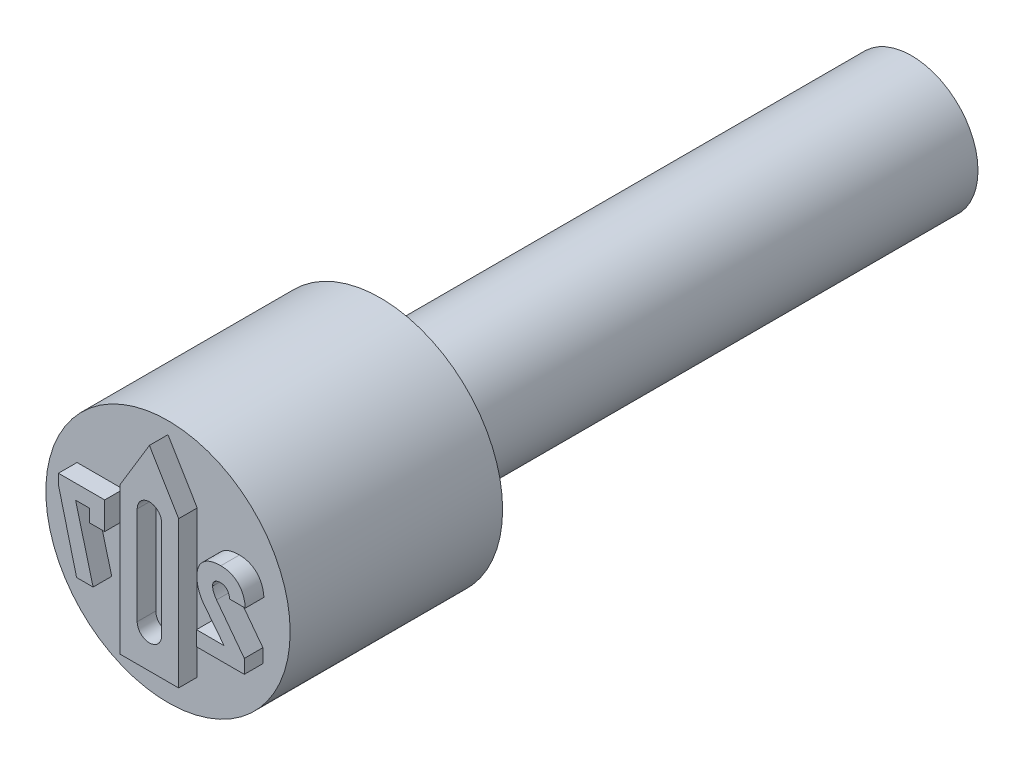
ISO-10303-21;
HEADER;
FILE_DESCRIPTION(('STEP AP214'),'2;1');
FILE_NAME('part.step','',(''),(''),'','','');
FILE_SCHEMA(('AUTOMOTIVE_DESIGN { 1 0 10303 214 1 1 1 1 }'));
ENDSEC;
DATA;
#1=APPLICATION_CONTEXT('core data for automotive mechanical design processes');
#2=APPLICATION_PROTOCOL_DEFINITION('international standard','automotive_design',2000,#1);
#3=PRODUCT_CONTEXT('',#1,'mechanical');
#4=PRODUCT('Part','Part','',(#3));
#5=PRODUCT_RELATED_PRODUCT_CATEGORY('part','',(#4));
#6=PRODUCT_DEFINITION_FORMATION('','',#4);
#7=PRODUCT_DEFINITION_CONTEXT('part definition',#1,'design');
#8=PRODUCT_DEFINITION('design','',#6,#7);
#9=PRODUCT_DEFINITION_SHAPE('','',#8);
#10=(LENGTH_UNIT() NAMED_UNIT(*) SI_UNIT(.MILLI.,.METRE.));
#11=(NAMED_UNIT(*) PLANE_ANGLE_UNIT() SI_UNIT($,.RADIAN.));
#12=(NAMED_UNIT(*) SI_UNIT($,.STERADIAN.) SOLID_ANGLE_UNIT());
#13=UNCERTAINTY_MEASURE_WITH_UNIT(LENGTH_MEASURE(1.E-05),#10,'distance_accuracy_value','');
#14=(GEOMETRIC_REPRESENTATION_CONTEXT(3) GLOBAL_UNCERTAINTY_ASSIGNED_CONTEXT((#13)) GLOBAL_UNIT_ASSIGNED_CONTEXT((#10,
#11,#12)) REPRESENTATION_CONTEXT('',''));
#15=CARTESIAN_POINT('',(0.,0.,0.));
#16=DIRECTION('',(0.,0.,1.));
#17=DIRECTION('',(1.,0.,0.));
#18=AXIS2_PLACEMENT_3D('',#15,#16,#17);
#19=CARTESIAN_POINT('',(0.,2.3,0.));
#20=DIRECTION('',(0.,0.,-1.));
#21=DIRECTION('',(-1.,0.,0.));
#22=AXIS2_PLACEMENT_3D('',#19,#20,#21);
#23=PLANE('',#22);
#24=DIRECTION('',(-1.,0.,0.));
#25=VECTOR('',#24,1.);
#26=CARTESIAN_POINT('',(-0.841879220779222,0.76,0.));
#27=LINE('',#26,#25);
#28=CARTESIAN_POINT('',(-0.841879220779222,0.76,0.));
#29=VERTEX_POINT('',#28);
#30=CARTESIAN_POINT('',(-1.71243928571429,0.76,0.));
#31=VERTEX_POINT('',#30);
#32=EDGE_CURVE('E341',#29,#31,#27,.T.);
#33=ORIENTED_EDGE('',*,*,#32,.F.);
#34=DIRECTION('',(0.,1.,0.));
#35=VECTOR('',#34,1.);
#36=CARTESIAN_POINT('',(-0.841879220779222,0.243376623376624,0.));
#37=LINE('',#36,#35);
#38=CARTESIAN_POINT('',(-0.841879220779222,0.243376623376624,0.));
#39=VERTEX_POINT('',#38);
#40=EDGE_CURVE('E346',#39,#29,#37,.T.);
#41=ORIENTED_EDGE('',*,*,#40,.F.);
#42=DIRECTION('',(1.,0.,0.));
#43=VECTOR('',#42,1.);
#44=CARTESIAN_POINT('',(-1.12906469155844,0.243376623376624,0.));
#45=LINE('',#44,#43);
#46=CARTESIAN_POINT('',(-1.12906469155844,0.243376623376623,0.));
#47=VERTEX_POINT('',#46);
#48=EDGE_CURVE('E383',#47,#39,#45,.T.);
#49=ORIENTED_EDGE('',*,*,#48,.F.);
#50=DIRECTION('',(0.,-1.,0.));
#51=VECTOR('',#50,1.);
#52=CARTESIAN_POINT('',(-1.12906469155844,0.481818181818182,0.));
#53=LINE('',#52,#51);
#54=CARTESIAN_POINT('',(-1.12906469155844,0.481818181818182,0.));
#55=VERTEX_POINT('',#54);
#56=EDGE_CURVE('E380',#55,#47,#53,.T.);
#57=ORIENTED_EDGE('',*,*,#56,.F.);
#58=DIRECTION('',(1.,0.,0.));
#59=VECTOR('',#58,1.);
#60=CARTESIAN_POINT('',(-1.39079155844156,0.481818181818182,0.));
#61=LINE('',#60,#59);
#62=CARTESIAN_POINT('',(-1.39079155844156,0.481818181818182,0.));
#63=VERTEX_POINT('',#62);
#64=EDGE_CURVE('E377',#63,#55,#61,.T.);
#65=ORIENTED_EDGE('',*,*,#64,.F.);
#66=DIRECTION('',(-0.255602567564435,0.966781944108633,0.));
#67=VECTOR('',#66,1.);
#68=CARTESIAN_POINT('',(-1.05982970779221,-0.77,0.));
#69=LINE('',#68,#67);
#70=CARTESIAN_POINT('',(-1.05982970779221,-0.77,0.));
#71=VERTEX_POINT('',#70);
#72=EDGE_CURVE('E374',#71,#63,#69,.T.);
#73=ORIENTED_EDGE('',*,*,#72,.F.);
#74=DIRECTION('',(1.,0.,0.));
#75=VECTOR('',#74,1.);
#76=CARTESIAN_POINT('',(-1.37092142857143,-0.77,0.));
#77=LINE('',#76,#75);
#78=CARTESIAN_POINT('',(-1.37092142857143,-0.77,0.));
#79=VERTEX_POINT('',#78);
#80=EDGE_CURVE('E371',#79,#71,#77,.T.);
#81=ORIENTED_EDGE('',*,*,#80,.F.);
#82=DIRECTION('',(0.247293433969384,-0.968940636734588,0.));
#83=VECTOR('',#82,1.);
#84=CARTESIAN_POINT('',(-1.71243928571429,0.568129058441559,0.));
#85=LINE('',#84,#83);
#86=CARTESIAN_POINT('',(-1.71243928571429,0.568129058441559,0.));
#87=VERTEX_POINT('',#86);
#88=EDGE_CURVE('E368',#87,#79,#85,.T.);
#89=ORIENTED_EDGE('',*,*,#88,.F.);
#90=DIRECTION('',(0.,-1.,0.));
#91=VECTOR('',#90,1.);
#92=CARTESIAN_POINT('',(-1.71243928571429,0.76,0.));
#93=LINE('',#92,#91);
#94=EDGE_CURVE('E365',#31,#87,#93,.T.);
#95=ORIENTED_EDGE('',*,*,#94,.F.);
#96=EDGE_LOOP('',(#33,#41,#49,#57,#65,#73,#81,#89,#95));
#97=FACE_BOUND('',#96,.T.);
#98=CARTESIAN_POINT('',(0.,0.,0.));
#99=DIRECTION('',(0.,0.,1.));
#100=DIRECTION('',(1.,0.,0.));
#101=AXIS2_PLACEMENT_3D('',#98,#99,#100);
#102=CIRCLE('',#101,2.3);
#103=CARTESIAN_POINT('',(2.3,0.,0.));
#104=VERTEX_POINT('',#103);
#105=EDGE_CURVE('E47',#104,#104,#102,.T.);
#106=ORIENTED_EDGE('',*,*,#105,.T.);
#107=EDGE_LOOP('',(#106));
#108=FACE_BOUND('',#107,.T.);
#109=DIRECTION('',(1.,0.,0.));
#110=VECTOR('',#109,1.);
#111=CARTESIAN_POINT('',(0.885691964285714,-0.77,0.));
#112=LINE('',#111,#110);
#113=CARTESIAN_POINT('',(0.885691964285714,-0.77,0.));
#114=VERTEX_POINT('',#113);
#115=CARTESIAN_POINT('',(1.78667816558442,-0.77,0.));
#116=VERTEX_POINT('',#115);
#117=EDGE_CURVE('E414',#114,#116,#112,.T.);
#118=ORIENTED_EDGE('',*,*,#117,.F.);
#119=DIRECTION('',(0.,-1.,0.));
#120=VECTOR('',#119,1.);
#121=CARTESIAN_POINT('',(0.885691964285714,-0.491818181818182,0.));
#122=LINE('',#121,#120);
#123=CARTESIAN_POINT('',(0.885691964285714,-0.491818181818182,0.));
#124=VERTEX_POINT('',#123);
#125=EDGE_CURVE('E419',#124,#114,#122,.T.);
#126=ORIENTED_EDGE('',*,*,#125,.F.);
#127=DIRECTION('',(-1.,0.,0.));
#128=VECTOR('',#127,1.);
#129=CARTESIAN_POINT('',(1.40635146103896,-0.491818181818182,0.));
#130=LINE('',#129,#128);
#131=CARTESIAN_POINT('',(1.40635146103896,-0.491818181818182,0.));
#132=VERTEX_POINT('',#131);
#133=EDGE_CURVE('E676',#132,#124,#130,.T.);
#134=ORIENTED_EDGE('',*,*,#133,.F.);
#135=DIRECTION('',(0.618183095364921,-0.78603413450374,0.));
#136=VECTOR('',#135,1.);
#137=CARTESIAN_POINT('',(1.03130275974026,-0.0149350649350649,0.));
#138=LINE('',#137,#136);
#139=CARTESIAN_POINT('',(1.03130275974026,-0.0149350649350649,0.));
#140=VERTEX_POINT('',#139);
#141=EDGE_CURVE('E670',#140,#132,#138,.T.);
#142=ORIENTED_EDGE('',*,*,#141,.F.);
#143=CARTESIAN_POINT('',(0.894074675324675,0.378741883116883,0.));
#144=CARTESIAN_POINT('',(0.894470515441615,0.361333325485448,0.));
#145=CARTESIAN_POINT('',(0.895262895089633,0.326485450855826,0.));
#146=CARTESIAN_POINT('',(0.902415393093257,0.274330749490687,0.));
#147=CARTESIAN_POINT('',(0.913941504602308,0.222442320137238,0.));
#148=CARTESIAN_POINT('',(0.929770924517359,0.171070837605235,0.));
#149=CARTESIAN_POINT('',(0.949435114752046,0.121106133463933,0.));
#150=CARTESIAN_POINT('',(0.973035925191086,0.073232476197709,0.));
#151=CARTESIAN_POINT('',(0.999672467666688,0.0274286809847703,0.));
#152=CARTESIAN_POINT('',(1.02077951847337,-0.000840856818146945,0.));
#153=CARTESIAN_POINT('',(1.03130275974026,-0.0149350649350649,0.));
#154=B_SPLINE_CURVE_WITH_KNOTS('',3,(#143,#144,#145,#146,#147,#148,#149,#150,#151,#152,#153),
.UNSPECIFIED.,.F.,.F.,(4,1,1,1,1,1,1,1,4),(0.,0.123046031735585,0.246309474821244,
0.371480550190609,0.498560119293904,0.626024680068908,0.750715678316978,0.875715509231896,1.),.UNSPECIFIED.);
#155=CARTESIAN_POINT('',(0.894074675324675,0.378741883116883,0.));
#156=VERTEX_POINT('',#155);
#157=EDGE_CURVE('E665',#156,#140,#154,.T.);
#158=ORIENTED_EDGE('',*,*,#157,.F.);
#159=DIRECTION('',(0.,-1.,0.));
#160=VECTOR('',#159,1.);
#161=CARTESIAN_POINT('',(0.894074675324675,0.379983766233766,0.));
#162=LINE('',#161,#160);
#163=CARTESIAN_POINT('',(0.894074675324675,0.379983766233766,0.));
#164=VERTEX_POINT('',#163);
#165=EDGE_CURVE('E659',#164,#156,#162,.T.);
#166=ORIENTED_EDGE('',*,*,#165,.F.);
#167=CARTESIAN_POINT('',(1.34456777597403,0.77987012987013,0.));
#168=CARTESIAN_POINT('',(1.32716738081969,0.779622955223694,0.));
#169=CARTESIAN_POINT('',(1.29332591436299,0.779142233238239,0.));
#170=CARTESIAN_POINT('',(1.24405859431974,0.773952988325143,0.));
#171=CARTESIAN_POINT('',(1.19770327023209,0.766120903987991,0.));
#172=CARTESIAN_POINT('',(1.15433453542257,0.754662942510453,0.));
#173=CARTESIAN_POINT('',(1.11412649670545,0.739717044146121,0.));
#174=CARTESIAN_POINT('',(1.07695870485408,0.721695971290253,0.));
#175=CARTESIAN_POINT('',(1.04275346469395,0.700446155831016,0.));
#176=CARTESIAN_POINT('',(1.01177273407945,0.675922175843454,0.));
#177=CARTESIAN_POINT('',(0.983897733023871,0.648569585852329,0.));
#178=CARTESIAN_POINT('',(0.959904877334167,0.618110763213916,0.));
#179=CARTESIAN_POINT('',(0.939135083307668,0.585161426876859,0.));
#180=CARTESIAN_POINT('',(0.922899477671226,0.54908249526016,0.));
#181=CARTESIAN_POINT('',(0.909533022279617,0.510722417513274,0.));
#182=CARTESIAN_POINT('',(0.900878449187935,0.469393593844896,0.));
#183=CARTESIAN_POINT('',(0.895046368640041,0.425582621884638,0.));
#184=CARTESIAN_POINT('',(0.894403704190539,0.395424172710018,0.));
#185=CARTESIAN_POINT('',(0.894074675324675,0.379983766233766,0.));
#186=B_SPLINE_CURVE_WITH_KNOTS('',3,(#167,#168,#169,#170,#171,#172,#173,#174,#175,#176,#177,
#178,#179,#180,#181,#182,#183,#184,#185),.UNSPECIFIED.,.F.,.F.,(4,1,1,1,1,1,1,1,1,1,1,1,1,1,1,1,
4),(0.,0.0762312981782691,0.148259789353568,0.216860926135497,0.282100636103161,
0.344528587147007,0.404571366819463,0.462840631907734,0.520642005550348,0.577409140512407,
0.633580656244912,0.690215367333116,0.747647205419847,0.806597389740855,0.867894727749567,
0.932365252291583,1.),.UNSPECIFIED.);
#187=CARTESIAN_POINT('',(1.34456777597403,0.77987012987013,0.));
#188=VERTEX_POINT('',#187);
#189=EDGE_CURVE('E651',#188,#164,#186,.T.);
#190=ORIENTED_EDGE('',*,*,#189,.F.);
#191=CARTESIAN_POINT('',(1.80561688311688,0.320683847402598,0.));
#192=CARTESIAN_POINT('',(1.80416456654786,0.338418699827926,0.));
#193=CARTESIAN_POINT('',(1.80132967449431,0.373036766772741,0.));
#194=CARTESIAN_POINT('',(1.79203566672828,0.423113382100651,0.));
#195=CARTESIAN_POINT('',(1.78002352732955,0.470282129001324,0.));
#196=CARTESIAN_POINT('',(1.76474246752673,0.514533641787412,0.));
#197=CARTESIAN_POINT('',(1.74510625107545,0.555355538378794,0.));
#198=CARTESIAN_POINT('',(1.72304436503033,0.59360119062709,0.));
#199=CARTESIAN_POINT('',(1.69650944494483,0.628087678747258,0.));
#200=CARTESIAN_POINT('',(1.66746325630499,0.659968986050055,0.));
#201=CARTESIAN_POINT('',(1.63511099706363,0.688049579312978,0.));
#202=CARTESIAN_POINT('',(1.60061459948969,0.712820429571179,0.));
#203=CARTESIAN_POINT('',(1.56345242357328,0.733433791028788,0.));
#204=CARTESIAN_POINT('',(1.52418943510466,0.750533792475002,0.));
#205=CARTESIAN_POINT('',(1.482390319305,0.763512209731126,0.));
#206=CARTESIAN_POINT('',(1.43860107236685,0.773234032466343,0.));
#207=CARTESIAN_POINT('',(1.39231907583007,0.77884063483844,0.));
#208=CARTESIAN_POINT('',(1.36072725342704,0.779521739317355,0.));
#209=CARTESIAN_POINT('',(1.34456777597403,0.77987012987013,0.));
#210=B_SPLINE_CURVE_WITH_KNOTS('',3,(#191,#192,#193,#194,#195,#196,#197,#198,#199,#200,#201,
#202,#203,#204,#205,#206,#207,#208,#209),.UNSPECIFIED.,.F.,.F.,(4,1,1,1,1,1,1,1,1,1,1,1,1,1,1,1,
4),(0.,0.073326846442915,0.143132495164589,0.209679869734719,0.273918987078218,0.33576228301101,
0.396210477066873,0.455608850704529,0.514796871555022,0.573764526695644,0.631900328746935,
0.689592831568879,0.748648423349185,0.808163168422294,0.86976604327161,0.933384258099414,1.),.UNSPECIFIED.);
#211=CARTESIAN_POINT('',(1.80561688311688,0.320683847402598,0.));
#212=VERTEX_POINT('',#211);
#213=EDGE_CURVE('E646',#212,#188,#210,.T.);
#214=ORIENTED_EDGE('',*,*,#213,.F.);
#215=DIRECTION('',(0.,1.,0.));
#216=VECTOR('',#215,1.);
#217=CARTESIAN_POINT('',(1.80561688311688,0.319752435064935,0.));
#218=LINE('',#217,#216);
#219=CARTESIAN_POINT('',(1.80561688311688,0.319752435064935,0.));
#220=VERTEX_POINT('',#219);
#221=EDGE_CURVE('E643',#220,#212,#218,.T.);
#222=ORIENTED_EDGE('',*,*,#221,.F.);
#223=DIRECTION('',(1.,0.,0.));
#224=VECTOR('',#223,1.);
#225=CARTESIAN_POINT('',(1.51129058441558,0.319752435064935,0.));
#226=LINE('',#225,#224);
#227=CARTESIAN_POINT('',(1.51129058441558,0.319752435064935,0.));
#228=VERTEX_POINT('',#227);
#229=EDGE_CURVE('E640',#228,#220,#226,.T.);
#230=ORIENTED_EDGE('',*,*,#229,.F.);
#231=DIRECTION('',(0.,-1.,0.));
#232=VECTOR('',#231,1.);
#233=CARTESIAN_POINT('',(1.51129058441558,0.320683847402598,0.));
#234=LINE('',#233,#232);
#235=CARTESIAN_POINT('',(1.51129058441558,0.320683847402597,0.));
#236=VERTEX_POINT('',#235);
#237=EDGE_CURVE('E634',#236,#228,#234,.T.);
#238=ORIENTED_EDGE('',*,*,#237,.F.);
#239=CARTESIAN_POINT('',(1.34239448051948,0.501688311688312,0.));
#240=CARTESIAN_POINT('',(1.35364222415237,0.501249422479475,0.));
#241=CARTESIAN_POINT('',(1.37549698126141,0.500396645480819,0.));
#242=CARTESIAN_POINT('',(1.40643611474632,0.490945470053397,0.));
#243=CARTESIAN_POINT('',(1.43431529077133,0.47612061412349,0.));
#244=CARTESIAN_POINT('',(1.45834935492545,0.454967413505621,0.));
#245=CARTESIAN_POINT('',(1.47825138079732,0.428408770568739,0.));
#246=CARTESIAN_POINT('',(1.49440380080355,0.397133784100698,0.));
#247=CARTESIAN_POINT('',(1.50537440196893,0.360577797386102,0.));
#248=CARTESIAN_POINT('',(1.50925506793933,0.33440972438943,0.));
#249=CARTESIAN_POINT('',(1.51129058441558,0.320683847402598,0.));
#250=B_SPLINE_CURVE_WITH_KNOTS('',3,(#239,#240,#241,#242,#243,#244,#245,#246,#247,#248,#249),
.UNSPECIFIED.,.F.,.F.,(4,1,1,1,1,1,1,1,4),(0.,0.122603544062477,0.238222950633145,
0.350089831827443,0.465559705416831,0.58502806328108,0.711014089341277,0.848418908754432,1.),.UNSPECIFIED.);
#251=CARTESIAN_POINT('',(1.34239448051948,0.501688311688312,0.));
#252=VERTEX_POINT('',#251);
#253=EDGE_CURVE('E626',#252,#236,#250,.T.);
#254=ORIENTED_EDGE('',*,*,#253,.F.);
#255=CARTESIAN_POINT('',(1.18964285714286,0.371911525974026,0.));
#256=CARTESIAN_POINT('',(1.19006697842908,0.381694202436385,0.));
#257=CARTESIAN_POINT('',(1.19087952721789,0.400436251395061,0.));
#258=CARTESIAN_POINT('',(1.1985350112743,0.426844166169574,0.));
#259=CARTESIAN_POINT('',(1.21108193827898,0.449841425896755,0.));
#260=CARTESIAN_POINT('',(1.22905216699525,0.468837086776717,0.));
#261=CARTESIAN_POINT('',(1.25142372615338,0.483861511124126,0.));
#262=CARTESIAN_POINT('',(1.27819191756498,0.494449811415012,0.));
#263=CARTESIAN_POINT('',(1.30900650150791,0.500521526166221,0.));
#264=CARTESIAN_POINT('',(1.33087858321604,0.501285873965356,0.));
#265=CARTESIAN_POINT('',(1.34239448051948,0.501688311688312,0.));
#266=B_SPLINE_CURVE_WITH_KNOTS('',3,(#255,#256,#257,#258,#259,#260,#261,#262,#263,#264,#265),
.UNSPECIFIED.,.F.,.F.,(4,1,1,1,1,1,1,1,4),(0.,0.128749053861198,0.246662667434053,
0.359069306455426,0.471077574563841,0.588039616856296,0.711712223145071,0.848213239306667,1.),.UNSPECIFIED.);
#267=CARTESIAN_POINT('',(1.18964285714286,0.371911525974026,0.));
#268=VERTEX_POINT('',#267);
#269=EDGE_CURVE('E621',#268,#252,#266,.T.);
#270=ORIENTED_EDGE('',*,*,#269,.F.);
#271=DIRECTION('',(0.,1.,0.));
#272=VECTOR('',#271,1.);
#273=CARTESIAN_POINT('',(1.18964285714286,0.369738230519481,0.));
#274=LINE('',#273,#272);
#275=CARTESIAN_POINT('',(1.18964285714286,0.369738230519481,0.));
#276=VERTEX_POINT('',#275);
#277=EDGE_CURVE('E615',#276,#268,#274,.T.);
#278=ORIENTED_EDGE('',*,*,#277,.F.);
#279=CARTESIAN_POINT('',(1.26384537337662,0.182834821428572,0.));
#280=CARTESIAN_POINT('',(1.25289454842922,0.198265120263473,0.));
#281=CARTESIAN_POINT('',(1.23155719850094,0.228330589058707,0.));
#282=CARTESIAN_POINT('',(1.21224525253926,0.269619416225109,0.));
#283=CARTESIAN_POINT('',(1.20021470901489,0.301990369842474,0.));
#284=CARTESIAN_POINT('',(1.19448121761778,0.325465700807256,0.));
#285=CARTESIAN_POINT('',(1.19039112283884,0.347863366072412,0.));
#286=CARTESIAN_POINT('',(1.18988770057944,0.362580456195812,0.));
#287=CARTESIAN_POINT('',(1.18964285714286,0.369738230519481,0.));
#288=B_SPLINE_CURVE_WITH_KNOTS('',3,(#279,#280,#281,#282,#283,#284,#285,#286,#287),
.UNSPECIFIED.,.F.,.F.,(4,1,1,1,1,1,4),(0.,0.277375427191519,0.540457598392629,0.666416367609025,
0.784009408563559,0.894951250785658,1.),.UNSPECIFIED.);
#289=CARTESIAN_POINT('',(1.26384537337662,0.182834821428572,0.));
#290=VERTEX_POINT('',#289);
#291=EDGE_CURVE('E610',#290,#276,#288,.T.);
#292=ORIENTED_EDGE('',*,*,#291,.F.);
#293=DIRECTION('',(-0.602458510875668,0.798150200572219,0.));
#294=VECTOR('',#293,1.);
#295=CARTESIAN_POINT('',(1.78667816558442,-0.509825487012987,0.));
#296=LINE('',#295,#294);
#297=CARTESIAN_POINT('',(1.78667816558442,-0.509825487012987,0.));
#298=VERTEX_POINT('',#297);
#299=EDGE_CURVE('E607',#298,#290,#296,.T.);
#300=ORIENTED_EDGE('',*,*,#299,.F.);
#301=DIRECTION('',(0.,1.,0.));
#302=VECTOR('',#301,1.);
#303=CARTESIAN_POINT('',(1.78667816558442,-0.77,0.));
#304=LINE('',#303,#302);
#305=EDGE_CURVE('E604',#116,#298,#304,.T.);
#306=ORIENTED_EDGE('',*,*,#305,.F.);
#307=EDGE_LOOP('',(#118,#126,#134,#142,#158,#166,#190,#214,#222,#230,#238,#254,#270,#278,#292,
#300,#306));
#308=FACE_BOUND('',#307,.T.);
#309=DIRECTION('',(0.,-1.,0.));
#310=VECTOR('',#309,1.);
#311=CARTESIAN_POINT('',(-0.55,1.15925816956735,0.));
#312=LINE('',#311,#310);
#313=CARTESIAN_POINT('',(-0.55,1.15925816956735,0.));
#314=VERTEX_POINT('',#313);
#315=CARTESIAN_POINT('',(-0.55,-1.61,0.));
#316=VERTEX_POINT('',#315);
#317=EDGE_CURVE('E300',#314,#316,#312,.T.);
#318=ORIENTED_EDGE('',*,*,#317,.F.);
#319=DIRECTION('',(-0.51695047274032,-0.856015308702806,0.));
#320=VECTOR('',#319,1.);
#321=CARTESIAN_POINT('',(0.,2.07,0.));
#322=LINE('',#321,#320);
#323=CARTESIAN_POINT('',(0.,2.07,0.));
#324=VERTEX_POINT('',#323);
#325=EDGE_CURVE('E308',#324,#314,#322,.T.);
#326=ORIENTED_EDGE('',*,*,#325,.F.);
#327=DIRECTION('',(-0.513123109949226,0.858315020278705,0.));
#328=VECTOR('',#327,1.);
#329=CARTESIAN_POINT('',(0.55,1.15,0.));
#330=LINE('',#329,#328);
#331=CARTESIAN_POINT('',(0.55,1.15,0.));
#332=VERTEX_POINT('',#331);
#333=EDGE_CURVE('E323',#332,#324,#330,.T.);
#334=ORIENTED_EDGE('',*,*,#333,.F.);
#335=DIRECTION('',(0.,1.,0.));
#336=VECTOR('',#335,1.);
#337=CARTESIAN_POINT('',(0.55,-1.61,0.));
#338=LINE('',#337,#336);
#339=CARTESIAN_POINT('',(0.55,-1.61,0.));
#340=VERTEX_POINT('',#339);
#341=EDGE_CURVE('E320',#340,#332,#338,.T.);
#342=ORIENTED_EDGE('',*,*,#341,.F.);
#343=DIRECTION('',(1.,0.,0.));
#344=VECTOR('',#343,1.);
#345=CARTESIAN_POINT('',(-0.55,-1.61,0.));
#346=LINE('',#345,#344);
#347=EDGE_CURVE('E62',#316,#340,#346,.T.);
#348=ORIENTED_EDGE('',*,*,#347,.F.);
#349=EDGE_LOOP('',(#318,#326,#334,#342,#348));
#350=FACE_BOUND('',#349,.T.);
#351=ADVANCED_FACE('F39',(#97,#108,#308,#350),#23,.F.);
#352=CARTESIAN_POINT('',(0.,1.25,-4.));
#353=DIRECTION('',(0.,0.,1.));
#354=DIRECTION('',(1.,0.,0.));
#355=AXIS2_PLACEMENT_3D('',#352,#353,#354);
#356=PLANE('',#355);
#357=CARTESIAN_POINT('',(0.,0.,-4.));
#358=DIRECTION('',(0.,0.,1.));
#359=DIRECTION('',(1.,0.,0.));
#360=AXIS2_PLACEMENT_3D('',#357,#358,#359);
#361=CIRCLE('',#360,2.3);
#362=CARTESIAN_POINT('',(2.3,0.,-4.));
#363=VERTEX_POINT('',#362);
#364=EDGE_CURVE('E11',#363,#363,#361,.T.);
#365=ORIENTED_EDGE('',*,*,#364,.F.);
#366=EDGE_LOOP('',(#365));
#367=FACE_BOUND('',#366,.T.);
#368=CARTESIAN_POINT('',(0.,0.,-4.));
#369=DIRECTION('',(0.,0.,1.));
#370=DIRECTION('',(1.,0.,0.));
#371=AXIS2_PLACEMENT_3D('',#368,#369,#370);
#372=CIRCLE('',#371,1.25);
#373=CARTESIAN_POINT('',(1.25,0.,-4.));
#374=VERTEX_POINT('',#373);
#375=EDGE_CURVE('E477',#374,#374,#372,.T.);
#376=ORIENTED_EDGE('',*,*,#375,.T.);
#377=EDGE_LOOP('',(#376));
#378=FACE_BOUND('',#377,.T.);
#379=ADVANCED_FACE('F41',(#367,#378),#356,.F.);
#380=CARTESIAN_POINT('',(0.,0.,-0.403888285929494));
#381=DIRECTION('',(0.,0.,1.));
#382=DIRECTION('',(1.,0.,0.));
#383=AXIS2_PLACEMENT_3D('',#380,#381,#382);
#384=CYLINDRICAL_SURFACE('',#383,2.3);
#385=ORIENTED_EDGE('',*,*,#105,.F.);
#386=EDGE_LOOP('',(#385));
#387=FACE_BOUND('',#386,.T.);
#388=ORIENTED_EDGE('',*,*,#364,.T.);
#389=EDGE_LOOP('',(#388));
#390=FACE_BOUND('',#389,.T.);
#391=ADVANCED_FACE('F460',(#387,#390),#384,.T.);
#392=CARTESIAN_POINT('',(0.,0.,-14.));
#393=DIRECTION('',(0.,0.,1.));
#394=DIRECTION('',(1.,0.,0.));
#395=AXIS2_PLACEMENT_3D('',#392,#393,#394);
#396=PLANE('',#395);
#397=CARTESIAN_POINT('',(0.,0.,-14.));
#398=DIRECTION('',(0.,0.,1.));
#399=DIRECTION('',(1.,0.,0.));
#400=AXIS2_PLACEMENT_3D('',#397,#398,#399);
#401=CIRCLE('',#400,1.25);
#402=CARTESIAN_POINT('',(1.25,0.,-14.));
#403=VERTEX_POINT('',#402);
#404=EDGE_CURVE('E478',#403,#403,#401,.T.);
#405=ORIENTED_EDGE('',*,*,#404,.F.);
#406=EDGE_LOOP('',(#405));
#407=FACE_BOUND('',#406,.T.);
#408=ADVANCED_FACE('F456',(#407),#396,.F.);
#409=CARTESIAN_POINT('',(0.,0.,-0.403888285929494));
#410=DIRECTION('',(0.,0.,1.));
#411=DIRECTION('',(1.,0.,0.));
#412=AXIS2_PLACEMENT_3D('',#409,#410,#411);
#413=CYLINDRICAL_SURFACE('',#412,1.25);
#414=ORIENTED_EDGE('',*,*,#375,.F.);
#415=EDGE_LOOP('',(#414));
#416=FACE_BOUND('',#415,.T.);
#417=ORIENTED_EDGE('',*,*,#404,.T.);
#418=EDGE_LOOP('',(#417));
#419=FACE_BOUND('',#418,.T.);
#420=ADVANCED_FACE('F452',(#416,#419),#413,.T.);
#421=CARTESIAN_POINT('',(0.885691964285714,-0.77,0.35));
#422=DIRECTION('',(0.,1.,0.));
#423=DIRECTION('',(0.,0.,1.));
#424=AXIS2_PLACEMENT_3D('',#421,#422,#423);
#425=PLANE('',#424);
#426=ORIENTED_EDGE('',*,*,#117,.T.);
#427=DIRECTION('',(0.,0.,-1.));
#428=VECTOR('',#427,1.);
#429=CARTESIAN_POINT('',(1.78667816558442,-0.77,0.35));
#430=LINE('',#429,#428);
#431=CARTESIAN_POINT('',(1.78667816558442,-0.77,0.35));
#432=VERTEX_POINT('',#431);
#433=EDGE_CURVE('E479',#432,#116,#430,.T.);
#434=ORIENTED_EDGE('',*,*,#433,.F.);
#435=DIRECTION('',(1.,0.,0.));
#436=VECTOR('',#435,1.);
#437=CARTESIAN_POINT('',(0.885691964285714,-0.77,0.35));
#438=LINE('',#437,#436);
#439=CARTESIAN_POINT('',(0.885691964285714,-0.77,0.35));
#440=VERTEX_POINT('',#439);
#441=EDGE_CURVE('E415',#440,#432,#438,.T.);
#442=ORIENTED_EDGE('',*,*,#441,.F.);
#443=DIRECTION('',(0.,0.,-1.));
#444=VECTOR('',#443,1.);
#445=CARTESIAN_POINT('',(0.885691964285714,-0.77,0.35));
#446=LINE('',#445,#444);
#447=EDGE_CURVE('E602',#440,#114,#446,.T.);
#448=ORIENTED_EDGE('',*,*,#447,.T.);
#449=EDGE_LOOP('',(#426,#434,#442,#448));
#450=FACE_BOUND('',#449,.T.);
#451=ADVANCED_FACE('F448',(#450),#425,.F.);
#452=CARTESIAN_POINT('',(1.78667816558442,-0.77,0.35));
#453=DIRECTION('',(-1.,0.,0.));
#454=DIRECTION('',(0.,0.,1.));
#455=AXIS2_PLACEMENT_3D('',#452,#453,#454);
#456=PLANE('',#455);
#457=ORIENTED_EDGE('',*,*,#305,.T.);
#458=DIRECTION('',(0.,0.,-1.));
#459=VECTOR('',#458,1.);
#460=CARTESIAN_POINT('',(1.78667816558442,-0.509825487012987,0.35));
#461=LINE('',#460,#459);
#462=CARTESIAN_POINT('',(1.78667816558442,-0.509825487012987,0.35));
#463=VERTEX_POINT('',#462);
#464=EDGE_CURVE('E484',#463,#298,#461,.T.);
#465=ORIENTED_EDGE('',*,*,#464,.F.);
#466=DIRECTION('',(0.,1.,0.));
#467=VECTOR('',#466,1.);
#468=CARTESIAN_POINT('',(1.78667816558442,-0.77,0.35));
#469=LINE('',#468,#467);
#470=EDGE_CURVE('E418',#432,#463,#469,.T.);
#471=ORIENTED_EDGE('',*,*,#470,.F.);
#472=ORIENTED_EDGE('',*,*,#433,.T.);
#473=EDGE_LOOP('',(#457,#465,#471,#472));
#474=FACE_BOUND('',#473,.T.);
#475=ADVANCED_FACE('F444',(#474),#456,.F.);
#476=CARTESIAN_POINT('',(1.78667816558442,-0.509825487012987,0.35));
#477=DIRECTION('',(-0.798150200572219,-0.602458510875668,0.));
#478=DIRECTION('',(0.602458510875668,-0.798150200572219,0.));
#479=AXIS2_PLACEMENT_3D('',#476,#477,#478);
#480=PLANE('',#479);
#481=ORIENTED_EDGE('',*,*,#299,.T.);
#482=DIRECTION('',(0.,0.,-1.));
#483=VECTOR('',#482,1.);
#484=CARTESIAN_POINT('',(1.26384537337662,0.182834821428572,0.35));
#485=LINE('',#484,#483);
#486=CARTESIAN_POINT('',(1.26384537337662,0.182834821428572,0.35));
#487=VERTEX_POINT('',#486);
#488=EDGE_CURVE('E721',#487,#290,#485,.T.);
#489=ORIENTED_EDGE('',*,*,#488,.F.);
#490=DIRECTION('',(-0.602458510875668,0.798150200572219,0.));
#491=VECTOR('',#490,1.);
#492=CARTESIAN_POINT('',(1.78667816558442,-0.509825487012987,0.35));
#493=LINE('',#492,#491);
#494=EDGE_CURVE('E421',#463,#487,#493,.T.);
#495=ORIENTED_EDGE('',*,*,#494,.F.);
#496=ORIENTED_EDGE('',*,*,#464,.T.);
#497=EDGE_LOOP('',(#481,#489,#495,#496));
#498=FACE_BOUND('',#497,.T.);
#499=ADVANCED_FACE('F439',(#498),#480,.F.);
#500=CARTESIAN_POINT('',(1.26384537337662,0.182834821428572,0.35));
#501=CARTESIAN_POINT('',(1.25289454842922,0.198265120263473,0.35));
#502=CARTESIAN_POINT('',(1.23155719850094,0.228330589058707,0.35));
#503=CARTESIAN_POINT('',(1.21224525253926,0.269619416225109,0.35));
#504=CARTESIAN_POINT('',(1.20021470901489,0.301990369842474,0.35));
#505=CARTESIAN_POINT('',(1.19448121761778,0.325465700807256,0.35));
#506=CARTESIAN_POINT('',(1.19039112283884,0.347863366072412,0.35));
#507=CARTESIAN_POINT('',(1.18988770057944,0.362580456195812,0.35));
#508=CARTESIAN_POINT('',(1.18964285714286,0.369738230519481,0.35));
#509=B_SPLINE_CURVE_WITH_KNOTS('',3,(#500,#501,#502,#503,#504,#505,#506,#507,#508),
.UNSPECIFIED.,.F.,.F.,(4,1,1,1,1,1,4),(0.,0.277375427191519,0.540457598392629,0.666416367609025,
0.784009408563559,0.894951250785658,1.),.UNSPECIFIED.);
#510=DIRECTION('',(0.,0.,-1.));
#511=VECTOR('',#510,1.);
#512=SURFACE_OF_LINEAR_EXTRUSION('',#509,#511);
#513=ORIENTED_EDGE('',*,*,#291,.T.);
#514=DIRECTION('',(0.,0.,-1.));
#515=VECTOR('',#514,1.);
#516=CARTESIAN_POINT('',(1.18964285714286,0.369738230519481,0.35));
#517=LINE('',#516,#515);
#518=CARTESIAN_POINT('',(1.18964285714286,0.369738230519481,0.35));
#519=VERTEX_POINT('',#518);
#520=EDGE_CURVE('E718',#519,#276,#517,.T.);
#521=ORIENTED_EDGE('',*,*,#520,.F.);
#522=EDGE_CURVE('E423',#487,#519,#509,.T.);
#523=ORIENTED_EDGE('',*,*,#522,.F.);
#524=ORIENTED_EDGE('',*,*,#488,.T.);
#525=EDGE_LOOP('',(#513,#521,#523,#524));
#526=FACE_BOUND('',#525,.T.);
#527=ADVANCED_FACE('F434',(#526),#512,.F.);
#528=CARTESIAN_POINT('',(1.18964285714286,0.369738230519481,0.35));
#529=DIRECTION('',(-1.,0.,0.));
#530=DIRECTION('',(0.,0.,1.));
#531=AXIS2_PLACEMENT_3D('',#528,#529,#530);
#532=PLANE('',#531);
#533=ORIENTED_EDGE('',*,*,#277,.T.);
#534=DIRECTION('',(0.,0.,-1.));
#535=VECTOR('',#534,1.);
#536=CARTESIAN_POINT('',(1.18964285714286,0.371911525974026,0.35));
#537=LINE('',#536,#535);
#538=CARTESIAN_POINT('',(1.18964285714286,0.371911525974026,0.35));
#539=VERTEX_POINT('',#538);
#540=EDGE_CURVE('E715',#539,#268,#537,.T.);
#541=ORIENTED_EDGE('',*,*,#540,.F.);
#542=DIRECTION('',(0.,1.,0.));
#543=VECTOR('',#542,1.);
#544=CARTESIAN_POINT('',(1.18964285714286,0.369738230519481,0.35));
#545=LINE('',#544,#543);
#546=EDGE_CURVE('E428',#519,#539,#545,.T.);
#547=ORIENTED_EDGE('',*,*,#546,.F.);
#548=ORIENTED_EDGE('',*,*,#520,.T.);
#549=EDGE_LOOP('',(#533,#541,#547,#548));
#550=FACE_BOUND('',#549,.T.);
#551=ADVANCED_FACE('F438',(#550),#532,.F.);
#552=CARTESIAN_POINT('',(1.18964285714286,0.371911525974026,0.35));
#553=CARTESIAN_POINT('',(1.19006697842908,0.381694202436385,0.35));
#554=CARTESIAN_POINT('',(1.19087952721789,0.400436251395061,0.35));
#555=CARTESIAN_POINT('',(1.1985350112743,0.426844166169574,0.35));
#556=CARTESIAN_POINT('',(1.21108193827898,0.449841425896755,0.35));
#557=CARTESIAN_POINT('',(1.22905216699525,0.468837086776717,0.35));
#558=CARTESIAN_POINT('',(1.25142372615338,0.483861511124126,0.35));
#559=CARTESIAN_POINT('',(1.27819191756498,0.494449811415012,0.35));
#560=CARTESIAN_POINT('',(1.30900650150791,0.500521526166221,0.35));
#561=CARTESIAN_POINT('',(1.33087858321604,0.501285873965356,0.35));
#562=CARTESIAN_POINT('',(1.34239448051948,0.501688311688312,0.35));
#563=B_SPLINE_CURVE_WITH_KNOTS('',3,(#552,#553,#554,#555,#556,#557,#558,#559,#560,#561,#562),
.UNSPECIFIED.,.F.,.F.,(4,1,1,1,1,1,1,1,4),(0.,0.128749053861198,0.246662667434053,
0.359069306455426,0.471077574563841,0.588039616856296,0.711712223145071,0.848213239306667,1.),.UNSPECIFIED.);
#564=DIRECTION('',(0.,0.,-1.));
#565=VECTOR('',#564,1.);
#566=SURFACE_OF_LINEAR_EXTRUSION('',#563,#565);
#567=ORIENTED_EDGE('',*,*,#269,.T.);
#568=DIRECTION('',(0.,0.,-1.));
#569=VECTOR('',#568,1.);
#570=CARTESIAN_POINT('',(1.34239448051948,0.501688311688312,0.35));
#571=LINE('',#570,#569);
#572=CARTESIAN_POINT('',(1.34239448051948,0.501688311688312,0.35));
#573=VERTEX_POINT('',#572);
#574=EDGE_CURVE('E712',#573,#252,#571,.T.);
#575=ORIENTED_EDGE('',*,*,#574,.F.);
#576=EDGE_CURVE('E734',#539,#573,#563,.T.);
#577=ORIENTED_EDGE('',*,*,#576,.F.);
#578=ORIENTED_EDGE('',*,*,#540,.T.);
#579=EDGE_LOOP('',(#567,#575,#577,#578));
#580=FACE_BOUND('',#579,.T.);
#581=ADVANCED_FACE('F749',(#580),#566,.F.);
#582=CARTESIAN_POINT('',(1.34239448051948,0.501688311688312,0.35));
#583=CARTESIAN_POINT('',(1.35364222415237,0.501249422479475,0.35));
#584=CARTESIAN_POINT('',(1.37549698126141,0.500396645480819,0.35));
#585=CARTESIAN_POINT('',(1.40643611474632,0.490945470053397,0.35));
#586=CARTESIAN_POINT('',(1.43431529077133,0.47612061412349,0.35));
#587=CARTESIAN_POINT('',(1.45834935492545,0.454967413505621,0.35));
#588=CARTESIAN_POINT('',(1.47825138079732,0.428408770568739,0.35));
#589=CARTESIAN_POINT('',(1.49440380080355,0.397133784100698,0.35));
#590=CARTESIAN_POINT('',(1.50537440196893,0.360577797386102,0.35));
#591=CARTESIAN_POINT('',(1.50925506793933,0.33440972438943,0.35));
#592=CARTESIAN_POINT('',(1.51129058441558,0.320683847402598,0.35));
#593=B_SPLINE_CURVE_WITH_KNOTS('',3,(#582,#583,#584,#585,#586,#587,#588,#589,#590,#591,#592),
.UNSPECIFIED.,.F.,.F.,(4,1,1,1,1,1,1,1,4),(0.,0.122603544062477,0.238222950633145,
0.350089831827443,0.465559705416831,0.58502806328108,0.711014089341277,0.848418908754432,1.),.UNSPECIFIED.);
#594=DIRECTION('',(0.,0.,-1.));
#595=VECTOR('',#594,1.);
#596=SURFACE_OF_LINEAR_EXTRUSION('',#593,#595);
#597=ORIENTED_EDGE('',*,*,#253,.T.);
#598=DIRECTION('',(0.,0.,-1.));
#599=VECTOR('',#598,1.);
#600=CARTESIAN_POINT('',(1.51129058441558,0.320683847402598,0.35));
#601=LINE('',#600,#599);
#602=CARTESIAN_POINT('',(1.51129058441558,0.320683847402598,0.35));
#603=VERTEX_POINT('',#602);
#604=EDGE_CURVE('E709',#603,#236,#601,.T.);
#605=ORIENTED_EDGE('',*,*,#604,.F.);
#606=EDGE_CURVE('E735',#573,#603,#593,.T.);
#607=ORIENTED_EDGE('',*,*,#606,.F.);
#608=ORIENTED_EDGE('',*,*,#574,.T.);
#609=EDGE_LOOP('',(#597,#605,#607,#608));
#610=FACE_BOUND('',#609,.T.);
#611=ADVANCED_FACE('F752',(#610),#596,.F.);
#612=CARTESIAN_POINT('',(1.51129058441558,0.320683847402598,0.35));
#613=DIRECTION('',(1.,0.,0.));
#614=DIRECTION('',(0.,0.,-1.));
#615=AXIS2_PLACEMENT_3D('',#612,#613,#614);
#616=PLANE('',#615);
#617=ORIENTED_EDGE('',*,*,#237,.T.);
#618=DIRECTION('',(0.,0.,-1.));
#619=VECTOR('',#618,1.);
#620=CARTESIAN_POINT('',(1.51129058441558,0.319752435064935,0.35));
#621=LINE('',#620,#619);
#622=CARTESIAN_POINT('',(1.51129058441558,0.319752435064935,0.35));
#623=VERTEX_POINT('',#622);
#624=EDGE_CURVE('E706',#623,#228,#621,.T.);
#625=ORIENTED_EDGE('',*,*,#624,.F.);
#626=DIRECTION('',(0.,-1.,0.));
#627=VECTOR('',#626,1.);
#628=CARTESIAN_POINT('',(1.51129058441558,0.320683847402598,0.35));
#629=LINE('',#628,#627);
#630=EDGE_CURVE('E737',#603,#623,#629,.T.);
#631=ORIENTED_EDGE('',*,*,#630,.F.);
#632=ORIENTED_EDGE('',*,*,#604,.T.);
#633=EDGE_LOOP('',(#617,#625,#631,#632));
#634=FACE_BOUND('',#633,.T.);
#635=ADVANCED_FACE('F756',(#634),#616,.F.);
#636=CARTESIAN_POINT('',(1.51129058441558,0.319752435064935,0.35));
#637=DIRECTION('',(0.,1.,0.));
#638=DIRECTION('',(0.,0.,1.));
#639=AXIS2_PLACEMENT_3D('',#636,#637,#638);
#640=PLANE('',#639);
#641=ORIENTED_EDGE('',*,*,#229,.T.);
#642=DIRECTION('',(0.,0.,-1.));
#643=VECTOR('',#642,1.);
#644=CARTESIAN_POINT('',(1.80561688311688,0.319752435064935,0.35));
#645=LINE('',#644,#643);
#646=CARTESIAN_POINT('',(1.80561688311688,0.319752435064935,0.35));
#647=VERTEX_POINT('',#646);
#648=EDGE_CURVE('E703',#647,#220,#645,.T.);
#649=ORIENTED_EDGE('',*,*,#648,.F.);
#650=DIRECTION('',(1.,0.,0.));
#651=VECTOR('',#650,1.);
#652=CARTESIAN_POINT('',(1.51129058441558,0.319752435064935,0.35));
#653=LINE('',#652,#651);
#654=EDGE_CURVE('E812',#623,#647,#653,.T.);
#655=ORIENTED_EDGE('',*,*,#654,.F.);
#656=ORIENTED_EDGE('',*,*,#624,.T.);
#657=EDGE_LOOP('',(#641,#649,#655,#656));
#658=FACE_BOUND('',#657,.T.);
#659=ADVANCED_FACE('F760',(#658),#640,.F.);
#660=CARTESIAN_POINT('',(1.80561688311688,0.319752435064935,0.35));
#661=DIRECTION('',(-1.,0.,0.));
#662=DIRECTION('',(0.,0.,1.));
#663=AXIS2_PLACEMENT_3D('',#660,#661,#662);
#664=PLANE('',#663);
#665=ORIENTED_EDGE('',*,*,#221,.T.);
#666=DIRECTION('',(0.,0.,-1.));
#667=VECTOR('',#666,1.);
#668=CARTESIAN_POINT('',(1.80561688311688,0.320683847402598,0.35));
#669=LINE('',#668,#667);
#670=CARTESIAN_POINT('',(1.80561688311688,0.320683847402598,0.35));
#671=VERTEX_POINT('',#670);
#672=EDGE_CURVE('E700',#671,#212,#669,.T.);
#673=ORIENTED_EDGE('',*,*,#672,.F.);
#674=DIRECTION('',(0.,1.,0.));
#675=VECTOR('',#674,1.);
#676=CARTESIAN_POINT('',(1.80561688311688,0.319752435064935,0.35));
#677=LINE('',#676,#675);
#678=EDGE_CURVE('E780',#647,#671,#677,.T.);
#679=ORIENTED_EDGE('',*,*,#678,.F.);
#680=ORIENTED_EDGE('',*,*,#648,.T.);
#681=EDGE_LOOP('',(#665,#673,#679,#680));
#682=FACE_BOUND('',#681,.T.);
#683=ADVANCED_FACE('F764',(#682),#664,.F.);
#684=CARTESIAN_POINT('',(1.80561688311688,0.320683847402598,0.35));
#685=CARTESIAN_POINT('',(1.80416456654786,0.338418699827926,0.35));
#686=CARTESIAN_POINT('',(1.80132967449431,0.373036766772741,0.35));
#687=CARTESIAN_POINT('',(1.79203566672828,0.423113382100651,0.35));
#688=CARTESIAN_POINT('',(1.78002352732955,0.470282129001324,0.35));
#689=CARTESIAN_POINT('',(1.76474246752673,0.514533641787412,0.35));
#690=CARTESIAN_POINT('',(1.74510625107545,0.555355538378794,0.35));
#691=CARTESIAN_POINT('',(1.72304436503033,0.59360119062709,0.35));
#692=CARTESIAN_POINT('',(1.69650944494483,0.628087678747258,0.35));
#693=CARTESIAN_POINT('',(1.66746325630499,0.659968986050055,0.35));
#694=CARTESIAN_POINT('',(1.63511099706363,0.688049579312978,0.35));
#695=CARTESIAN_POINT('',(1.60061459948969,0.712820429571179,0.35));
#696=CARTESIAN_POINT('',(1.56345242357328,0.733433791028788,0.35));
#697=CARTESIAN_POINT('',(1.52418943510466,0.750533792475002,0.35));
#698=CARTESIAN_POINT('',(1.482390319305,0.763512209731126,0.35));
#699=CARTESIAN_POINT('',(1.43860107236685,0.773234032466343,0.35));
#700=CARTESIAN_POINT('',(1.39231907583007,0.77884063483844,0.35));
#701=CARTESIAN_POINT('',(1.36072725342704,0.779521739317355,0.35));
#702=CARTESIAN_POINT('',(1.34456777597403,0.77987012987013,0.35));
#703=B_SPLINE_CURVE_WITH_KNOTS('',3,(#684,#685,#686,#687,#688,#689,#690,#691,#692,#693,#694,
#695,#696,#697,#698,#699,#700,#701,#702),.UNSPECIFIED.,.F.,.F.,(4,1,1,1,1,1,1,1,1,1,1,1,1,1,1,1,
4),(0.,0.073326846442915,0.143132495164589,0.209679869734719,0.273918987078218,0.33576228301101,
0.396210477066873,0.455608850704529,0.514796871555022,0.573764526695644,0.631900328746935,
0.689592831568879,0.748648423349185,0.808163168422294,0.86976604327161,0.933384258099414,1.),.UNSPECIFIED.);
#704=DIRECTION('',(0.,0.,-1.));
#705=VECTOR('',#704,1.);
#706=SURFACE_OF_LINEAR_EXTRUSION('',#703,#705);
#707=ORIENTED_EDGE('',*,*,#213,.T.);
#708=DIRECTION('',(0.,0.,-1.));
#709=VECTOR('',#708,1.);
#710=CARTESIAN_POINT('',(1.34456777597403,0.77987012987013,0.35));
#711=LINE('',#710,#709);
#712=CARTESIAN_POINT('',(1.34456777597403,0.77987012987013,0.35));
#713=VERTEX_POINT('',#712);
#714=EDGE_CURVE('E697',#713,#188,#711,.T.);
#715=ORIENTED_EDGE('',*,*,#714,.F.);
#716=EDGE_CURVE('E774',#671,#713,#703,.T.);
#717=ORIENTED_EDGE('',*,*,#716,.F.);
#718=ORIENTED_EDGE('',*,*,#672,.T.);
#719=EDGE_LOOP('',(#707,#715,#717,#718));
#720=FACE_BOUND('',#719,.T.);
#721=ADVANCED_FACE('F768',(#720),#706,.F.);
#722=CARTESIAN_POINT('',(1.34456777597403,0.77987012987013,0.35));
#723=CARTESIAN_POINT('',(1.32716738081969,0.779622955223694,0.35));
#724=CARTESIAN_POINT('',(1.29332591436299,0.779142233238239,0.35));
#725=CARTESIAN_POINT('',(1.24405859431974,0.773952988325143,0.35));
#726=CARTESIAN_POINT('',(1.19770327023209,0.766120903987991,0.35));
#727=CARTESIAN_POINT('',(1.15433453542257,0.754662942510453,0.35));
#728=CARTESIAN_POINT('',(1.11412649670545,0.739717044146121,0.35));
#729=CARTESIAN_POINT('',(1.07695870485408,0.721695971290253,0.35));
#730=CARTESIAN_POINT('',(1.04275346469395,0.700446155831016,0.35));
#731=CARTESIAN_POINT('',(1.01177273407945,0.675922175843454,0.35));
#732=CARTESIAN_POINT('',(0.983897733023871,0.648569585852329,0.35));
#733=CARTESIAN_POINT('',(0.959904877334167,0.618110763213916,0.35));
#734=CARTESIAN_POINT('',(0.939135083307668,0.585161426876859,0.35));
#735=CARTESIAN_POINT('',(0.922899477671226,0.54908249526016,0.35));
#736=CARTESIAN_POINT('',(0.909533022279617,0.510722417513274,0.35));
#737=CARTESIAN_POINT('',(0.900878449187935,0.469393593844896,0.35));
#738=CARTESIAN_POINT('',(0.895046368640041,0.425582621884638,0.35));
#739=CARTESIAN_POINT('',(0.894403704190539,0.395424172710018,0.35));
#740=CARTESIAN_POINT('',(0.894074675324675,0.379983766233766,0.35));
#741=B_SPLINE_CURVE_WITH_KNOTS('',3,(#722,#723,#724,#725,#726,#727,#728,#729,#730,#731,#732,
#733,#734,#735,#736,#737,#738,#739,#740),.UNSPECIFIED.,.F.,.F.,(4,1,1,1,1,1,1,1,1,1,1,1,1,1,1,1,
4),(0.,0.0762312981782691,0.148259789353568,0.216860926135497,0.282100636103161,
0.344528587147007,0.404571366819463,0.462840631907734,0.520642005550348,0.577409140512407,
0.633580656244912,0.690215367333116,0.747647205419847,0.806597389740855,0.867894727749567,
0.932365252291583,1.),.UNSPECIFIED.);
#742=DIRECTION('',(0.,0.,-1.));
#743=VECTOR('',#742,1.);
#744=SURFACE_OF_LINEAR_EXTRUSION('',#741,#743);
#745=ORIENTED_EDGE('',*,*,#189,.T.);
#746=DIRECTION('',(0.,0.,-1.));
#747=VECTOR('',#746,1.);
#748=CARTESIAN_POINT('',(0.894074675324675,0.379983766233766,0.35));
#749=LINE('',#748,#747);
#750=CARTESIAN_POINT('',(0.894074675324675,0.379983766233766,0.35));
#751=VERTEX_POINT('',#750);
#752=EDGE_CURVE('E694',#751,#164,#749,.T.);
#753=ORIENTED_EDGE('',*,*,#752,.F.);
#754=EDGE_CURVE('E779',#713,#751,#741,.T.);
#755=ORIENTED_EDGE('',*,*,#754,.F.);
#756=ORIENTED_EDGE('',*,*,#714,.T.);
#757=EDGE_LOOP('',(#745,#753,#755,#756));
#758=FACE_BOUND('',#757,.T.);
#759=ADVANCED_FACE('F772',(#758),#744,.F.);
#760=CARTESIAN_POINT('',(0.894074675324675,0.379983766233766,0.35));
#761=DIRECTION('',(1.,0.,0.));
#762=DIRECTION('',(0.,0.,-1.));
#763=AXIS2_PLACEMENT_3D('',#760,#761,#762);
#764=PLANE('',#763);
#765=ORIENTED_EDGE('',*,*,#165,.T.);
#766=DIRECTION('',(0.,0.,-1.));
#767=VECTOR('',#766,1.);
#768=CARTESIAN_POINT('',(0.894074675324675,0.378741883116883,0.35));
#769=LINE('',#768,#767);
#770=CARTESIAN_POINT('',(0.894074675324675,0.378741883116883,0.35));
#771=VERTEX_POINT('',#770);
#772=EDGE_CURVE('E691',#771,#156,#769,.T.);
#773=ORIENTED_EDGE('',*,*,#772,.F.);
#774=DIRECTION('',(0.,-1.,0.));
#775=VECTOR('',#774,1.);
#776=CARTESIAN_POINT('',(0.894074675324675,0.379983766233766,0.35));
#777=LINE('',#776,#775);
#778=EDGE_CURVE('E592',#751,#771,#777,.T.);
#779=ORIENTED_EDGE('',*,*,#778,.F.);
#780=ORIENTED_EDGE('',*,*,#752,.T.);
#781=EDGE_LOOP('',(#765,#773,#779,#780));
#782=FACE_BOUND('',#781,.T.);
#783=ADVANCED_FACE('F582',(#782),#764,.F.);
#784=CARTESIAN_POINT('',(0.894074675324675,0.378741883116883,0.35));
#785=CARTESIAN_POINT('',(0.894470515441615,0.361333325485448,0.35));
#786=CARTESIAN_POINT('',(0.895262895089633,0.326485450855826,0.35));
#787=CARTESIAN_POINT('',(0.902415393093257,0.274330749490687,0.35));
#788=CARTESIAN_POINT('',(0.913941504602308,0.222442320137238,0.35));
#789=CARTESIAN_POINT('',(0.929770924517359,0.171070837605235,0.35));
#790=CARTESIAN_POINT('',(0.949435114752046,0.121106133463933,0.35));
#791=CARTESIAN_POINT('',(0.973035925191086,0.073232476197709,0.35));
#792=CARTESIAN_POINT('',(0.999672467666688,0.0274286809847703,0.35));
#793=CARTESIAN_POINT('',(1.02077951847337,-0.000840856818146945,0.35));
#794=CARTESIAN_POINT('',(1.03130275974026,-0.0149350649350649,0.35));
#795=B_SPLINE_CURVE_WITH_KNOTS('',3,(#784,#785,#786,#787,#788,#789,#790,#791,#792,#793,#794),
.UNSPECIFIED.,.F.,.F.,(4,1,1,1,1,1,1,1,4),(0.,0.123046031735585,0.246309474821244,
0.371480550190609,0.498560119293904,0.626024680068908,0.750715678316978,0.875715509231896,1.),.UNSPECIFIED.);
#796=DIRECTION('',(0.,0.,-1.));
#797=VECTOR('',#796,1.);
#798=SURFACE_OF_LINEAR_EXTRUSION('',#795,#797);
#799=ORIENTED_EDGE('',*,*,#157,.T.);
#800=DIRECTION('',(0.,0.,-1.));
#801=VECTOR('',#800,1.);
#802=CARTESIAN_POINT('',(1.03130275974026,-0.0149350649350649,0.35));
#803=LINE('',#802,#801);
#804=CARTESIAN_POINT('',(1.03130275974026,-0.0149350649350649,0.35));
#805=VERTEX_POINT('',#804);
#806=EDGE_CURVE('E688',#805,#140,#803,.T.);
#807=ORIENTED_EDGE('',*,*,#806,.F.);
#808=EDGE_CURVE('E585',#771,#805,#795,.T.);
#809=ORIENTED_EDGE('',*,*,#808,.F.);
#810=ORIENTED_EDGE('',*,*,#772,.T.);
#811=EDGE_LOOP('',(#799,#807,#809,#810));
#812=FACE_BOUND('',#811,.T.);
#813=ADVANCED_FACE('F577',(#812),#798,.F.);
#814=CARTESIAN_POINT('',(1.03130275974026,-0.0149350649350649,0.35));
#815=DIRECTION('',(0.78603413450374,0.618183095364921,0.));
#816=DIRECTION('',(-0.618183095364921,0.78603413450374,0.));
#817=AXIS2_PLACEMENT_3D('',#814,#815,#816);
#818=PLANE('',#817);
#819=ORIENTED_EDGE('',*,*,#141,.T.);
#820=DIRECTION('',(0.,0.,-1.));
#821=VECTOR('',#820,1.);
#822=CARTESIAN_POINT('',(1.40635146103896,-0.491818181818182,0.35));
#823=LINE('',#822,#821);
#824=CARTESIAN_POINT('',(1.40635146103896,-0.491818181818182,0.35));
#825=VERTEX_POINT('',#824);
#826=EDGE_CURVE('E685',#825,#132,#823,.T.);
#827=ORIENTED_EDGE('',*,*,#826,.F.);
#828=DIRECTION('',(0.618183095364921,-0.78603413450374,0.));
#829=VECTOR('',#828,1.);
#830=CARTESIAN_POINT('',(1.03130275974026,-0.0149350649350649,0.35));
#831=LINE('',#830,#829);
#832=EDGE_CURVE('E591',#805,#825,#831,.T.);
#833=ORIENTED_EDGE('',*,*,#832,.F.);
#834=ORIENTED_EDGE('',*,*,#806,.T.);
#835=EDGE_LOOP('',(#819,#827,#833,#834));
#836=FACE_BOUND('',#835,.T.);
#837=ADVANCED_FACE('F573',(#836),#818,.F.);
#838=CARTESIAN_POINT('',(1.40635146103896,-0.491818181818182,0.35));
#839=DIRECTION('',(0.,-1.,0.));
#840=DIRECTION('',(0.,0.,-1.));
#841=AXIS2_PLACEMENT_3D('',#838,#839,#840);
#842=PLANE('',#841);
#843=ORIENTED_EDGE('',*,*,#133,.T.);
#844=DIRECTION('',(0.,0.,-1.));
#845=VECTOR('',#844,1.);
#846=CARTESIAN_POINT('',(0.885691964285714,-0.491818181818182,0.35));
#847=LINE('',#846,#845);
#848=CARTESIAN_POINT('',(0.885691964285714,-0.491818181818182,0.35));
#849=VERTEX_POINT('',#848);
#850=EDGE_CURVE('E682',#849,#124,#847,.T.);
#851=ORIENTED_EDGE('',*,*,#850,.F.);
#852=DIRECTION('',(-1.,0.,0.));
#853=VECTOR('',#852,1.);
#854=CARTESIAN_POINT('',(1.40635146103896,-0.491818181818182,0.35));
#855=LINE('',#854,#853);
#856=EDGE_CURVE('E598',#825,#849,#855,.T.);
#857=ORIENTED_EDGE('',*,*,#856,.F.);
#858=ORIENTED_EDGE('',*,*,#826,.T.);
#859=EDGE_LOOP('',(#843,#851,#857,#858));
#860=FACE_BOUND('',#859,.T.);
#861=ADVANCED_FACE('F569',(#860),#842,.F.);
#862=CARTESIAN_POINT('',(0.885691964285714,-0.491818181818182,0.35));
#863=DIRECTION('',(1.,0.,0.));
#864=DIRECTION('',(0.,0.,-1.));
#865=AXIS2_PLACEMENT_3D('',#862,#863,#864);
#866=PLANE('',#865);
#867=ORIENTED_EDGE('',*,*,#125,.T.);
#868=ORIENTED_EDGE('',*,*,#447,.F.);
#869=DIRECTION('',(0.,-1.,0.));
#870=VECTOR('',#869,1.);
#871=CARTESIAN_POINT('',(0.885691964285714,-0.491818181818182,0.35));
#872=LINE('',#871,#870);
#873=EDGE_CURVE('E600',#849,#440,#872,.T.);
#874=ORIENTED_EDGE('',*,*,#873,.F.);
#875=ORIENTED_EDGE('',*,*,#850,.T.);
#876=EDGE_LOOP('',(#867,#868,#874,#875));
#877=FACE_BOUND('',#876,.T.);
#878=ADVANCED_FACE('F565',(#877),#866,.F.);
#879=CARTESIAN_POINT('',(1.21235782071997,0.270807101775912,0.35));
#880=DIRECTION('',(0.,0.,1.));
#881=DIRECTION('',(1.,0.,0.));
#882=AXIS2_PLACEMENT_3D('',#879,#880,#881);
#883=PLANE('',#882);
#884=ORIENTED_EDGE('',*,*,#441,.T.);
#885=ORIENTED_EDGE('',*,*,#470,.T.);
#886=ORIENTED_EDGE('',*,*,#494,.T.);
#887=ORIENTED_EDGE('',*,*,#522,.T.);
#888=ORIENTED_EDGE('',*,*,#546,.T.);
#889=ORIENTED_EDGE('',*,*,#576,.T.);
#890=ORIENTED_EDGE('',*,*,#606,.T.);
#891=ORIENTED_EDGE('',*,*,#630,.T.);
#892=ORIENTED_EDGE('',*,*,#654,.T.);
#893=ORIENTED_EDGE('',*,*,#678,.T.);
#894=ORIENTED_EDGE('',*,*,#716,.T.);
#895=ORIENTED_EDGE('',*,*,#754,.T.);
#896=ORIENTED_EDGE('',*,*,#778,.T.);
#897=ORIENTED_EDGE('',*,*,#808,.T.);
#898=ORIENTED_EDGE('',*,*,#832,.T.);
#899=ORIENTED_EDGE('',*,*,#856,.T.);
#900=ORIENTED_EDGE('',*,*,#873,.T.);
#901=EDGE_LOOP('',(#884,#885,#886,#887,#888,#889,#890,#891,#892,#893,#894,#895,#896,#897,#898,
#899,#900));
#902=FACE_BOUND('',#901,.T.);
#903=ADVANCED_FACE('F561',(#902),#883,.T.);
#904=CARTESIAN_POINT('',(-0.841879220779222,0.76,0.35));
#905=DIRECTION('',(0.,-1.,0.));
#906=DIRECTION('',(0.,0.,-1.));
#907=AXIS2_PLACEMENT_3D('',#904,#905,#906);
#908=PLANE('',#907);
#909=ORIENTED_EDGE('',*,*,#32,.T.);
#910=DIRECTION('',(0.,0.,-1.));
#911=VECTOR('',#910,1.);
#912=CARTESIAN_POINT('',(-1.71243928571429,0.76,0.35));
#913=LINE('',#912,#911);
#914=CARTESIAN_POINT('',(-1.71243928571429,0.76,0.35));
#915=VERTEX_POINT('',#914);
#916=EDGE_CURVE('E411',#915,#31,#913,.T.);
#917=ORIENTED_EDGE('',*,*,#916,.F.);
#918=DIRECTION('',(-1.,0.,0.));
#919=VECTOR('',#918,1.);
#920=CARTESIAN_POINT('',(-0.841879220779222,0.76,0.35));
#921=LINE('',#920,#919);
#922=CARTESIAN_POINT('',(-0.841879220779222,0.76,0.35));
#923=VERTEX_POINT('',#922);
#924=EDGE_CURVE('E342',#923,#915,#921,.T.);
#925=ORIENTED_EDGE('',*,*,#924,.F.);
#926=DIRECTION('',(0.,0.,-1.));
#927=VECTOR('',#926,1.);
#928=CARTESIAN_POINT('',(-0.841879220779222,0.76,0.35));
#929=LINE('',#928,#927);
#930=EDGE_CURVE('E362',#923,#29,#929,.T.);
#931=ORIENTED_EDGE('',*,*,#930,.T.);
#932=EDGE_LOOP('',(#909,#917,#925,#931));
#933=FACE_BOUND('',#932,.T.);
#934=ADVANCED_FACE('F557',(#933),#908,.F.);
#935=CARTESIAN_POINT('',(-1.71243928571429,0.76,0.35));
#936=DIRECTION('',(1.,0.,0.));
#937=DIRECTION('',(0.,0.,-1.));
#938=AXIS2_PLACEMENT_3D('',#935,#936,#937);
#939=PLANE('',#938);
#940=ORIENTED_EDGE('',*,*,#94,.T.);
#941=DIRECTION('',(0.,0.,-1.));
#942=VECTOR('',#941,1.);
#943=CARTESIAN_POINT('',(-1.71243928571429,0.568129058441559,0.35));
#944=LINE('',#943,#942);
#945=CARTESIAN_POINT('',(-1.71243928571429,0.568129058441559,0.35));
#946=VERTEX_POINT('',#945);
#947=EDGE_CURVE('E408',#946,#87,#944,.T.);
#948=ORIENTED_EDGE('',*,*,#947,.F.);
#949=DIRECTION('',(0.,-1.,0.));
#950=VECTOR('',#949,1.);
#951=CARTESIAN_POINT('',(-1.71243928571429,0.76,0.35));
#952=LINE('',#951,#950);
#953=EDGE_CURVE('E345',#915,#946,#952,.T.);
#954=ORIENTED_EDGE('',*,*,#953,.F.);
#955=ORIENTED_EDGE('',*,*,#916,.T.);
#956=EDGE_LOOP('',(#940,#948,#954,#955));
#957=FACE_BOUND('',#956,.T.);
#958=ADVANCED_FACE('F553',(#957),#939,.F.);
#959=CARTESIAN_POINT('',(-1.71243928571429,0.568129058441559,0.35));
#960=DIRECTION('',(0.968940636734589,0.247293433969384,0.));
#961=DIRECTION('',(-0.247293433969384,0.968940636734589,0.));
#962=AXIS2_PLACEMENT_3D('',#959,#960,#961);
#963=PLANE('',#962);
#964=ORIENTED_EDGE('',*,*,#88,.T.);
#965=DIRECTION('',(0.,0.,-1.));
#966=VECTOR('',#965,1.);
#967=CARTESIAN_POINT('',(-1.37092142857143,-0.77,0.35));
#968=LINE('',#967,#966);
#969=CARTESIAN_POINT('',(-1.37092142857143,-0.77,0.35));
#970=VERTEX_POINT('',#969);
#971=EDGE_CURVE('E405',#970,#79,#968,.T.);
#972=ORIENTED_EDGE('',*,*,#971,.F.);
#973=DIRECTION('',(0.247293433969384,-0.968940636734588,0.));
#974=VECTOR('',#973,1.);
#975=CARTESIAN_POINT('',(-1.71243928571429,0.568129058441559,0.35));
#976=LINE('',#975,#974);
#977=EDGE_CURVE('E348',#946,#970,#976,.T.);
#978=ORIENTED_EDGE('',*,*,#977,.F.);
#979=ORIENTED_EDGE('',*,*,#947,.T.);
#980=EDGE_LOOP('',(#964,#972,#978,#979));
#981=FACE_BOUND('',#980,.T.);
#982=ADVANCED_FACE('F549',(#981),#963,.F.);
#983=CARTESIAN_POINT('',(-1.37092142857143,-0.77,0.35));
#984=DIRECTION('',(0.,1.,0.));
#985=DIRECTION('',(0.,0.,1.));
#986=AXIS2_PLACEMENT_3D('',#983,#984,#985);
#987=PLANE('',#986);
#988=ORIENTED_EDGE('',*,*,#80,.T.);
#989=DIRECTION('',(0.,0.,-1.));
#990=VECTOR('',#989,1.);
#991=CARTESIAN_POINT('',(-1.05982970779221,-0.77,0.35));
#992=LINE('',#991,#990);
#993=CARTESIAN_POINT('',(-1.05982970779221,-0.77,0.35));
#994=VERTEX_POINT('',#993);
#995=EDGE_CURVE('E402',#994,#71,#992,.T.);
#996=ORIENTED_EDGE('',*,*,#995,.F.);
#997=DIRECTION('',(1.,0.,0.));
#998=VECTOR('',#997,1.);
#999=CARTESIAN_POINT('',(-1.37092142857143,-0.77,0.35));
#1000=LINE('',#999,#998);
#1001=EDGE_CURVE('E350',#970,#994,#1000,.T.);
#1002=ORIENTED_EDGE('',*,*,#1001,.F.);
#1003=ORIENTED_EDGE('',*,*,#971,.T.);
#1004=EDGE_LOOP('',(#988,#996,#1002,#1003));
#1005=FACE_BOUND('',#1004,.T.);
#1006=ADVANCED_FACE('F545',(#1005),#987,.F.);
#1007=CARTESIAN_POINT('',(-1.05982970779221,-0.77,0.35));
#1008=DIRECTION('',(-0.966781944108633,-0.255602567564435,0.));
#1009=DIRECTION('',(0.255602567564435,-0.966781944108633,0.));
#1010=AXIS2_PLACEMENT_3D('',#1007,#1008,#1009);
#1011=PLANE('',#1010);
#1012=ORIENTED_EDGE('',*,*,#72,.T.);
#1013=DIRECTION('',(0.,0.,-1.));
#1014=VECTOR('',#1013,1.);
#1015=CARTESIAN_POINT('',(-1.39079155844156,0.481818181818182,0.35));
#1016=LINE('',#1015,#1014);
#1017=CARTESIAN_POINT('',(-1.39079155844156,0.481818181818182,0.35));
#1018=VERTEX_POINT('',#1017);
#1019=EDGE_CURVE('E399',#1018,#63,#1016,.T.);
#1020=ORIENTED_EDGE('',*,*,#1019,.F.);
#1021=DIRECTION('',(-0.255602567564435,0.966781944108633,0.));
#1022=VECTOR('',#1021,1.);
#1023=CARTESIAN_POINT('',(-1.05982970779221,-0.77,0.35));
#1024=LINE('',#1023,#1022);
#1025=EDGE_CURVE('E352',#994,#1018,#1024,.T.);
#1026=ORIENTED_EDGE('',*,*,#1025,.F.);
#1027=ORIENTED_EDGE('',*,*,#995,.T.);
#1028=EDGE_LOOP('',(#1012,#1020,#1026,#1027));
#1029=FACE_BOUND('',#1028,.T.);
#1030=ADVANCED_FACE('F541',(#1029),#1011,.F.);
#1031=CARTESIAN_POINT('',(-1.39079155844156,0.481818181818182,0.35));
#1032=DIRECTION('',(0.,1.,0.));
#1033=DIRECTION('',(0.,0.,1.));
#1034=AXIS2_PLACEMENT_3D('',#1031,#1032,#1033);
#1035=PLANE('',#1034);
#1036=ORIENTED_EDGE('',*,*,#64,.T.);
#1037=DIRECTION('',(0.,0.,-1.));
#1038=VECTOR('',#1037,1.);
#1039=CARTESIAN_POINT('',(-1.12906469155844,0.481818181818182,0.35));
#1040=LINE('',#1039,#1038);
#1041=CARTESIAN_POINT('',(-1.12906469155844,0.481818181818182,0.35));
#1042=VERTEX_POINT('',#1041);
#1043=EDGE_CURVE('E396',#1042,#55,#1040,.T.);
#1044=ORIENTED_EDGE('',*,*,#1043,.F.);
#1045=DIRECTION('',(1.,0.,0.));
#1046=VECTOR('',#1045,1.);
#1047=CARTESIAN_POINT('',(-1.39079155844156,0.481818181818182,0.35));
#1048=LINE('',#1047,#1046);
#1049=EDGE_CURVE('E354',#1018,#1042,#1048,.T.);
#1050=ORIENTED_EDGE('',*,*,#1049,.F.);
#1051=ORIENTED_EDGE('',*,*,#1019,.T.);
#1052=EDGE_LOOP('',(#1036,#1044,#1050,#1051));
#1053=FACE_BOUND('',#1052,.T.);
#1054=ADVANCED_FACE('F537',(#1053),#1035,.F.);
#1055=CARTESIAN_POINT('',(-1.12906469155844,0.481818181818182,0.35));
#1056=DIRECTION('',(1.,0.,0.));
#1057=DIRECTION('',(0.,0.,-1.));
#1058=AXIS2_PLACEMENT_3D('',#1055,#1056,#1057);
#1059=PLANE('',#1058);
#1060=ORIENTED_EDGE('',*,*,#56,.T.);
#1061=DIRECTION('',(0.,0.,-1.));
#1062=VECTOR('',#1061,1.);
#1063=CARTESIAN_POINT('',(-1.12906469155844,0.243376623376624,0.35));
#1064=LINE('',#1063,#1062);
#1065=CARTESIAN_POINT('',(-1.12906469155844,0.243376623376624,0.35));
#1066=VERTEX_POINT('',#1065);
#1067=EDGE_CURVE('E393',#1066,#47,#1064,.T.);
#1068=ORIENTED_EDGE('',*,*,#1067,.F.);
#1069=DIRECTION('',(0.,-1.,0.));
#1070=VECTOR('',#1069,1.);
#1071=CARTESIAN_POINT('',(-1.12906469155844,0.481818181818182,0.35));
#1072=LINE('',#1071,#1070);
#1073=EDGE_CURVE('E356',#1042,#1066,#1072,.T.);
#1074=ORIENTED_EDGE('',*,*,#1073,.F.);
#1075=ORIENTED_EDGE('',*,*,#1043,.T.);
#1076=EDGE_LOOP('',(#1060,#1068,#1074,#1075));
#1077=FACE_BOUND('',#1076,.T.);
#1078=ADVANCED_FACE('F533',(#1077),#1059,.F.);
#1079=CARTESIAN_POINT('',(-1.12906469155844,0.243376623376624,0.35));
#1080=DIRECTION('',(0.,1.,0.));
#1081=DIRECTION('',(0.,0.,1.));
#1082=AXIS2_PLACEMENT_3D('',#1079,#1080,#1081);
#1083=PLANE('',#1082);
#1084=ORIENTED_EDGE('',*,*,#48,.T.);
#1085=DIRECTION('',(0.,0.,-1.));
#1086=VECTOR('',#1085,1.);
#1087=CARTESIAN_POINT('',(-0.841879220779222,0.243376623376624,0.35));
#1088=LINE('',#1087,#1086);
#1089=CARTESIAN_POINT('',(-0.841879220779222,0.243376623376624,0.35));
#1090=VERTEX_POINT('',#1089);
#1091=EDGE_CURVE('E390',#1090,#39,#1088,.T.);
#1092=ORIENTED_EDGE('',*,*,#1091,.F.);
#1093=DIRECTION('',(1.,0.,0.));
#1094=VECTOR('',#1093,1.);
#1095=CARTESIAN_POINT('',(-1.12906469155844,0.243376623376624,0.35));
#1096=LINE('',#1095,#1094);
#1097=EDGE_CURVE('E358',#1066,#1090,#1096,.T.);
#1098=ORIENTED_EDGE('',*,*,#1097,.F.);
#1099=ORIENTED_EDGE('',*,*,#1067,.T.);
#1100=EDGE_LOOP('',(#1084,#1092,#1098,#1099));
#1101=FACE_BOUND('',#1100,.T.);
#1102=ADVANCED_FACE('F529',(#1101),#1083,.F.);
#1103=CARTESIAN_POINT('',(-0.841879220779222,0.243376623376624,0.35));
#1104=DIRECTION('',(-1.,0.,0.));
#1105=DIRECTION('',(0.,0.,1.));
#1106=AXIS2_PLACEMENT_3D('',#1103,#1104,#1105);
#1107=PLANE('',#1106);
#1108=ORIENTED_EDGE('',*,*,#40,.T.);
#1109=ORIENTED_EDGE('',*,*,#930,.F.);
#1110=DIRECTION('',(0.,1.,0.));
#1111=VECTOR('',#1110,1.);
#1112=CARTESIAN_POINT('',(-0.841879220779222,0.243376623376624,0.35));
#1113=LINE('',#1112,#1111);
#1114=EDGE_CURVE('E360',#1090,#923,#1113,.T.);
#1115=ORIENTED_EDGE('',*,*,#1114,.F.);
#1116=ORIENTED_EDGE('',*,*,#1091,.T.);
#1117=EDGE_LOOP('',(#1108,#1109,#1115,#1116));
#1118=FACE_BOUND('',#1117,.T.);
#1119=ADVANCED_FACE('F525',(#1118),#1107,.F.);
#1120=CARTESIAN_POINT('',(0.,0.,0.35));
#1121=DIRECTION('',(0.,0.,1.));
#1122=DIRECTION('',(1.,0.,0.));
#1123=AXIS2_PLACEMENT_3D('',#1120,#1121,#1122);
#1124=PLANE('',#1123);
#1125=ORIENTED_EDGE('',*,*,#924,.T.);
#1126=ORIENTED_EDGE('',*,*,#953,.T.);
#1127=ORIENTED_EDGE('',*,*,#977,.T.);
#1128=ORIENTED_EDGE('',*,*,#1001,.T.);
#1129=ORIENTED_EDGE('',*,*,#1025,.T.);
#1130=ORIENTED_EDGE('',*,*,#1049,.T.);
#1131=ORIENTED_EDGE('',*,*,#1073,.T.);
#1132=ORIENTED_EDGE('',*,*,#1097,.T.);
#1133=ORIENTED_EDGE('',*,*,#1114,.T.);
#1134=EDGE_LOOP('',(#1125,#1126,#1127,#1128,#1129,#1130,#1131,#1132,#1133));
#1135=FACE_BOUND('',#1134,.T.);
#1136=ADVANCED_FACE('F519',(#1135),#1124,.T.);
#1137=CARTESIAN_POINT('',(-0.55,1.15925816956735,0.35));
#1138=DIRECTION('',(1.,0.,0.));
#1139=DIRECTION('',(0.,0.,-1.));
#1140=AXIS2_PLACEMENT_3D('',#1137,#1138,#1139);
#1141=PLANE('',#1140);
#1142=ORIENTED_EDGE('',*,*,#317,.T.);
#1143=DIRECTION('',(0.,0.,-1.));
#1144=VECTOR('',#1143,1.);
#1145=CARTESIAN_POINT('',(-0.55,-1.61,0.35));
#1146=LINE('',#1145,#1144);
#1147=CARTESIAN_POINT('',(-0.55,-1.61,0.35));
#1148=VERTEX_POINT('',#1147);
#1149=EDGE_CURVE('E339',#1148,#316,#1146,.T.);
#1150=ORIENTED_EDGE('',*,*,#1149,.F.);
#1151=DIRECTION('',(0.,-1.,0.));
#1152=VECTOR('',#1151,1.);
#1153=CARTESIAN_POINT('',(-0.55,1.15925816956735,0.35));
#1154=LINE('',#1153,#1152);
#1155=CARTESIAN_POINT('',(-0.55,1.15925816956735,0.35));
#1156=VERTEX_POINT('',#1155);
#1157=EDGE_CURVE('E304',#1156,#1148,#1154,.T.);
#1158=ORIENTED_EDGE('',*,*,#1157,.F.);
#1159=DIRECTION('',(0.,0.,-1.));
#1160=VECTOR('',#1159,1.);
#1161=CARTESIAN_POINT('',(-0.55,1.15925816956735,0.35));
#1162=LINE('',#1161,#1160);
#1163=EDGE_CURVE('E316',#1156,#314,#1162,.T.);
#1164=ORIENTED_EDGE('',*,*,#1163,.T.);
#1165=EDGE_LOOP('',(#1142,#1150,#1158,#1164));
#1166=FACE_BOUND('',#1165,.T.);
#1167=ADVANCED_FACE('F499',(#1166),#1141,.F.);
#1168=CARTESIAN_POINT('',(-0.55,-1.61,0.35));
#1169=DIRECTION('',(0.,1.,0.));
#1170=DIRECTION('',(0.,0.,1.));
#1171=AXIS2_PLACEMENT_3D('',#1168,#1169,#1170);
#1172=PLANE('',#1171);
#1173=ORIENTED_EDGE('',*,*,#347,.T.);
#1174=DIRECTION('',(0.,0.,-1.));
#1175=VECTOR('',#1174,1.);
#1176=CARTESIAN_POINT('',(0.55,-1.61,0.35));
#1177=LINE('',#1176,#1175);
#1178=CARTESIAN_POINT('',(0.55,-1.61,0.35));
#1179=VERTEX_POINT('',#1178);
#1180=EDGE_CURVE('E336',#1179,#340,#1177,.T.);
#1181=ORIENTED_EDGE('',*,*,#1180,.F.);
#1182=DIRECTION('',(1.,0.,0.));
#1183=VECTOR('',#1182,1.);
#1184=CARTESIAN_POINT('',(-0.55,-1.61,0.35));
#1185=LINE('',#1184,#1183);
#1186=EDGE_CURVE('E307',#1148,#1179,#1185,.T.);
#1187=ORIENTED_EDGE('',*,*,#1186,.F.);
#1188=ORIENTED_EDGE('',*,*,#1149,.T.);
#1189=EDGE_LOOP('',(#1173,#1181,#1187,#1188));
#1190=FACE_BOUND('',#1189,.T.);
#1191=ADVANCED_FACE('F511',(#1190),#1172,.F.);
#1192=CARTESIAN_POINT('',(0.55,-1.61,0.35));
#1193=DIRECTION('',(-1.,0.,0.));
#1194=DIRECTION('',(0.,-1.,0.));
#1195=AXIS2_PLACEMENT_3D('',#1192,#1193,#1194);
#1196=PLANE('',#1195);
#1197=ORIENTED_EDGE('',*,*,#341,.T.);
#1198=DIRECTION('',(0.,0.,-1.));
#1199=VECTOR('',#1198,1.);
#1200=CARTESIAN_POINT('',(0.55,1.15,0.35));
#1201=LINE('',#1200,#1199);
#1202=CARTESIAN_POINT('',(0.55,1.15,0.35));
#1203=VERTEX_POINT('',#1202);
#1204=EDGE_CURVE('E333',#1203,#332,#1201,.T.);
#1205=ORIENTED_EDGE('',*,*,#1204,.F.);
#1206=DIRECTION('',(0.,1.,0.));
#1207=VECTOR('',#1206,1.);
#1208=CARTESIAN_POINT('',(0.55,-1.61,0.35));
#1209=LINE('',#1208,#1207);
#1210=EDGE_CURVE('E310',#1179,#1203,#1209,.T.);
#1211=ORIENTED_EDGE('',*,*,#1210,.F.);
#1212=ORIENTED_EDGE('',*,*,#1180,.T.);
#1213=EDGE_LOOP('',(#1197,#1205,#1211,#1212));
#1214=FACE_BOUND('',#1213,.T.);
#1215=ADVANCED_FACE('F509',(#1214),#1196,.F.);
#1216=CARTESIAN_POINT('',(0.55,1.15,0.35));
#1217=DIRECTION('',(-0.858315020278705,-0.513123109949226,0.));
#1218=DIRECTION('',(0.513123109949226,-0.858315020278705,0.));
#1219=AXIS2_PLACEMENT_3D('',#1216,#1217,#1218);
#1220=PLANE('',#1219);
#1221=ORIENTED_EDGE('',*,*,#333,.T.);
#1222=DIRECTION('',(0.,0.,-1.));
#1223=VECTOR('',#1222,1.);
#1224=CARTESIAN_POINT('',(0.,2.07,0.35));
#1225=LINE('',#1224,#1223);
#1226=CARTESIAN_POINT('',(0.,2.07,0.35));
#1227=VERTEX_POINT('',#1226);
#1228=EDGE_CURVE('E330',#1227,#324,#1225,.T.);
#1229=ORIENTED_EDGE('',*,*,#1228,.F.);
#1230=DIRECTION('',(-0.513123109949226,0.858315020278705,0.));
#1231=VECTOR('',#1230,1.);
#1232=CARTESIAN_POINT('',(0.55,1.15,0.35));
#1233=LINE('',#1232,#1231);
#1234=EDGE_CURVE('E312',#1203,#1227,#1233,.T.);
#1235=ORIENTED_EDGE('',*,*,#1234,.F.);
#1236=ORIENTED_EDGE('',*,*,#1204,.T.);
#1237=EDGE_LOOP('',(#1221,#1229,#1235,#1236));
#1238=FACE_BOUND('',#1237,.T.);
#1239=ADVANCED_FACE('F507',(#1238),#1220,.F.);
#1240=CARTESIAN_POINT('',(0.,2.07,0.35));
#1241=DIRECTION('',(0.856015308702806,-0.51695047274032,0.));
#1242=DIRECTION('',(0.51695047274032,0.856015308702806,0.));
#1243=AXIS2_PLACEMENT_3D('',#1240,#1241,#1242);
#1244=PLANE('',#1243);
#1245=ORIENTED_EDGE('',*,*,#325,.T.);
#1246=ORIENTED_EDGE('',*,*,#1163,.F.);
#1247=DIRECTION('',(-0.51695047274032,-0.856015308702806,0.));
#1248=VECTOR('',#1247,1.);
#1249=CARTESIAN_POINT('',(0.,2.07,0.35));
#1250=LINE('',#1249,#1248);
#1251=EDGE_CURVE('E314',#1227,#1156,#1250,.T.);
#1252=ORIENTED_EDGE('',*,*,#1251,.F.);
#1253=ORIENTED_EDGE('',*,*,#1228,.T.);
#1254=EDGE_LOOP('',(#1245,#1246,#1252,#1253));
#1255=FACE_BOUND('',#1254,.T.);
#1256=ADVANCED_FACE('F495',(#1255),#1244,.F.);
#1257=CARTESIAN_POINT('',(0.,0.,0.35));
#1258=DIRECTION('',(0.,0.,1.));
#1259=DIRECTION('',(1.,0.,0.));
#1260=AXIS2_PLACEMENT_3D('',#1257,#1258,#1259);
#1261=PLANE('',#1260);
#1262=CARTESIAN_POINT('',(0.,0.92,0.35));
#1263=DIRECTION('',(0.,0.,1.));
#1264=DIRECTION('',(1.,0.,0.));
#1265=AXIS2_PLACEMENT_3D('',#1262,#1263,#1264);
#1266=CIRCLE('',#1265,0.23);
#1267=CARTESIAN_POINT('',(0.23,0.92,0.35));
#1268=VERTEX_POINT('',#1267);
#1269=CARTESIAN_POINT('',(-0.23,0.92,0.35));
#1270=VERTEX_POINT('',#1269);
#1271=EDGE_CURVE('E54',#1268,#1270,#1266,.T.);
#1272=ORIENTED_EDGE('',*,*,#1271,.F.);
#1273=DIRECTION('',(0.,-1.,0.));
#1274=VECTOR('',#1273,1.);
#1275=CARTESIAN_POINT('',(0.23,0.92,0.35));
#1276=LINE('',#1275,#1274);
#1277=CARTESIAN_POINT('',(0.23,-0.92,0.35));
#1278=VERTEX_POINT('',#1277);
#1279=EDGE_CURVE('E285',#1268,#1278,#1276,.T.);
#1280=ORIENTED_EDGE('',*,*,#1279,.T.);
#1281=CARTESIAN_POINT('',(0.,-0.92,0.35));
#1282=DIRECTION('',(0.,0.,1.));
#1283=DIRECTION('',(1.,0.,0.));
#1284=AXIS2_PLACEMENT_3D('',#1281,#1282,#1283);
#1285=CIRCLE('',#1284,0.23);
#1286=CARTESIAN_POINT('',(-0.23,-0.92,0.35));
#1287=VERTEX_POINT('',#1286);
#1288=EDGE_CURVE('E288',#1287,#1278,#1285,.T.);
#1289=ORIENTED_EDGE('',*,*,#1288,.F.);
#1290=DIRECTION('',(0.,-1.,0.));
#1291=VECTOR('',#1290,1.);
#1292=CARTESIAN_POINT('',(-0.23,0.92,0.35));
#1293=LINE('',#1292,#1291);
#1294=EDGE_CURVE('E294',#1270,#1287,#1293,.T.);
#1295=ORIENTED_EDGE('',*,*,#1294,.F.);
#1296=EDGE_LOOP('',(#1272,#1280,#1289,#1295));
#1297=FACE_BOUND('',#1296,.T.);
#1298=ORIENTED_EDGE('',*,*,#1157,.T.);
#1299=ORIENTED_EDGE('',*,*,#1186,.T.);
#1300=ORIENTED_EDGE('',*,*,#1210,.T.);
#1301=ORIENTED_EDGE('',*,*,#1234,.T.);
#1302=ORIENTED_EDGE('',*,*,#1251,.T.);
#1303=EDGE_LOOP('',(#1298,#1299,#1300,#1301,#1302));
#1304=FACE_BOUND('',#1303,.T.);
#1305=ADVANCED_FACE('F501',(#1297,#1304),#1261,.T.);
#1306=CARTESIAN_POINT('',(0.,0.92,0.));
#1307=DIRECTION('',(0.,0.,1.));
#1308=DIRECTION('',(1.,0.,0.));
#1309=AXIS2_PLACEMENT_3D('',#1306,#1307,#1308);
#1310=CYLINDRICAL_SURFACE('',#1309,0.23);
#1311=ORIENTED_EDGE('',*,*,#1271,.T.);
#1312=DIRECTION('',(0.,0.,1.));
#1313=VECTOR('',#1312,1.);
#1314=CARTESIAN_POINT('',(-0.23,0.92,0.));
#1315=LINE('',#1314,#1313);
#1316=CARTESIAN_POINT('',(-0.23,0.92,0.));
#1317=VERTEX_POINT('',#1316);
#1318=EDGE_CURVE('E264',#1317,#1270,#1315,.T.);
#1319=ORIENTED_EDGE('',*,*,#1318,.F.);
#1320=CARTESIAN_POINT('',(0.,0.92,0.));
#1321=DIRECTION('',(0.,0.,1.));
#1322=DIRECTION('',(1.,0.,0.));
#1323=AXIS2_PLACEMENT_3D('',#1320,#1321,#1322);
#1324=CIRCLE('',#1323,0.23);
#1325=CARTESIAN_POINT('',(0.23,0.92,0.));
#1326=VERTEX_POINT('',#1325);
#1327=EDGE_CURVE('E268',#1326,#1317,#1324,.T.);
#1328=ORIENTED_EDGE('',*,*,#1327,.F.);
#1329=DIRECTION('',(0.,0.,1.));
#1330=VECTOR('',#1329,1.);
#1331=CARTESIAN_POINT('',(0.23,0.92,0.));
#1332=LINE('',#1331,#1330);
#1333=EDGE_CURVE('E298',#1326,#1268,#1332,.T.);
#1334=ORIENTED_EDGE('',*,*,#1333,.T.);
#1335=EDGE_LOOP('',(#1311,#1319,#1328,#1334));
#1336=FACE_BOUND('',#1335,.T.);
#1337=ADVANCED_FACE('F266',(#1336),#1310,.F.);
#1338=CARTESIAN_POINT('',(0.23,0.92,0.));
#1339=DIRECTION('',(-1.,0.,0.));
#1340=DIRECTION('',(0.,-1.,0.));
#1341=AXIS2_PLACEMENT_3D('',#1338,#1339,#1340);
#1342=PLANE('',#1341);
#1343=ORIENTED_EDGE('',*,*,#1279,.F.);
#1344=ORIENTED_EDGE('',*,*,#1333,.F.);
#1345=DIRECTION('',(0.,-1.,0.));
#1346=VECTOR('',#1345,1.);
#1347=CARTESIAN_POINT('',(0.23,0.92,0.));
#1348=LINE('',#1347,#1346);
#1349=CARTESIAN_POINT('',(0.23,-0.92,0.));
#1350=VERTEX_POINT('',#1349);
#1351=EDGE_CURVE('E273',#1326,#1350,#1348,.T.);
#1352=ORIENTED_EDGE('',*,*,#1351,.T.);
#1353=DIRECTION('',(0.,0.,1.));
#1354=VECTOR('',#1353,1.);
#1355=CARTESIAN_POINT('',(0.23,-0.92,0.));
#1356=LINE('',#1355,#1354);
#1357=EDGE_CURVE('E301',#1350,#1278,#1356,.T.);
#1358=ORIENTED_EDGE('',*,*,#1357,.T.);
#1359=EDGE_LOOP('',(#1343,#1344,#1352,#1358));
#1360=FACE_BOUND('',#1359,.T.);
#1361=ADVANCED_FACE('F936',(#1360),#1342,.T.);
#1362=CARTESIAN_POINT('',(0.,-0.92,0.));
#1363=DIRECTION('',(0.,0.,1.));
#1364=DIRECTION('',(1.,0.,0.));
#1365=AXIS2_PLACEMENT_3D('',#1362,#1363,#1364);
#1366=CYLINDRICAL_SURFACE('',#1365,0.23);
#1367=ORIENTED_EDGE('',*,*,#1288,.T.);
#1368=ORIENTED_EDGE('',*,*,#1357,.F.);
#1369=CARTESIAN_POINT('',(0.,-0.92,0.));
#1370=DIRECTION('',(0.,0.,1.));
#1371=DIRECTION('',(1.,0.,0.));
#1372=AXIS2_PLACEMENT_3D('',#1369,#1370,#1371);
#1373=CIRCLE('',#1372,0.23);
#1374=CARTESIAN_POINT('',(-0.23,-0.92,0.));
#1375=VERTEX_POINT('',#1374);
#1376=EDGE_CURVE('E281',#1375,#1350,#1373,.T.);
#1377=ORIENTED_EDGE('',*,*,#1376,.F.);
#1378=DIRECTION('',(0.,0.,1.));
#1379=VECTOR('',#1378,1.);
#1380=CARTESIAN_POINT('',(-0.23,-0.92,0.));
#1381=LINE('',#1380,#1379);
#1382=EDGE_CURVE('E272',#1375,#1287,#1381,.T.);
#1383=ORIENTED_EDGE('',*,*,#1382,.T.);
#1384=EDGE_LOOP('',(#1367,#1368,#1377,#1383));
#1385=FACE_BOUND('',#1384,.T.);
#1386=ADVANCED_FACE('F946',(#1385),#1366,.F.);
#1387=CARTESIAN_POINT('',(-0.23,0.92,0.));
#1388=DIRECTION('',(-1.,0.,0.));
#1389=DIRECTION('',(0.,-1.,0.));
#1390=AXIS2_PLACEMENT_3D('',#1387,#1388,#1389);
#1391=PLANE('',#1390);
#1392=ORIENTED_EDGE('',*,*,#1294,.T.);
#1393=ORIENTED_EDGE('',*,*,#1382,.F.);
#1394=DIRECTION('',(0.,-1.,0.));
#1395=VECTOR('',#1394,1.);
#1396=CARTESIAN_POINT('',(-0.23,0.92,0.));
#1397=LINE('',#1396,#1395);
#1398=EDGE_CURVE('E276',#1317,#1375,#1397,.T.);
#1399=ORIENTED_EDGE('',*,*,#1398,.F.);
#1400=ORIENTED_EDGE('',*,*,#1318,.T.);
#1401=EDGE_LOOP('',(#1392,#1393,#1399,#1400));
#1402=FACE_BOUND('',#1401,.T.);
#1403=ADVANCED_FACE('F277',(#1402),#1391,.F.);
#1404=CARTESIAN_POINT('',(0.,0.92,0.));
#1405=DIRECTION('',(0.,0.,1.));
#1406=DIRECTION('',(1.,0.,0.));
#1407=AXIS2_PLACEMENT_3D('',#1404,#1405,#1406);
#1408=PLANE('',#1407);
#1409=ORIENTED_EDGE('',*,*,#1327,.T.);
#1410=ORIENTED_EDGE('',*,*,#1398,.T.);
#1411=ORIENTED_EDGE('',*,*,#1376,.T.);
#1412=ORIENTED_EDGE('',*,*,#1351,.F.);
#1413=EDGE_LOOP('',(#1409,#1410,#1411,#1412));
#1414=FACE_BOUND('',#1413,.T.);
#1415=ADVANCED_FACE('F284',(#1414),#1408,.T.);
#1416=CLOSED_SHELL('',(#351,#379,#391,#408,#420,#451,#475,#499,#527,#551,#581,#611,#635,#659,
#683,#721,#759,#783,#813,#837,#861,#878,#903,#934,#958,#982,#1006,#1030,#1054,#1078,#1102,#1119,
#1136,#1167,#1191,#1215,#1239,#1256,#1305,#1337,#1361,#1386,#1403,#1415));
#1417=MANIFOLD_SOLID_BREP('B2',#1416);
#1418=ADVANCED_BREP_SHAPE_REPRESENTATION('',(#18,#1417),#14);
#1419=SHAPE_DEFINITION_REPRESENTATION(#9,#1418);
ENDSEC;
END-ISO-10303-21;
